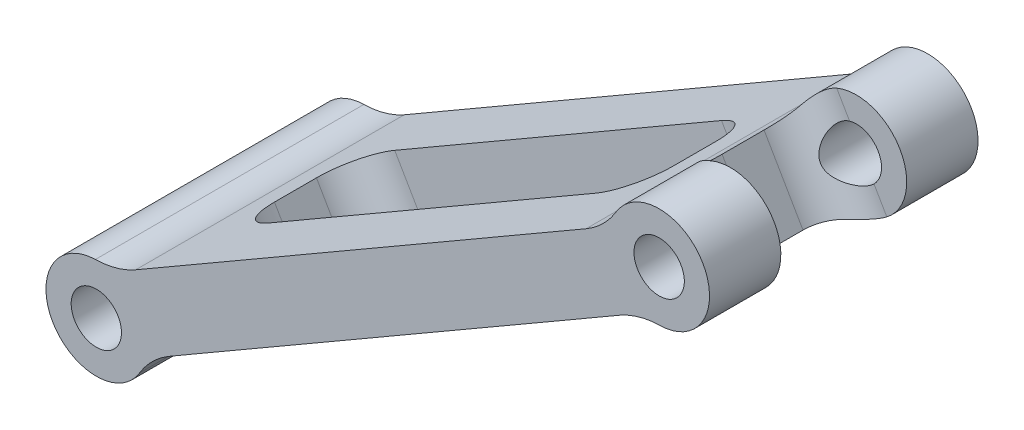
ISO-10303-21;
HEADER;
FILE_DESCRIPTION(('STEP AP214'),'2;1');
FILE_NAME('part.step','',(''),(''),'','','');
FILE_SCHEMA(('AUTOMOTIVE_DESIGN { 1 0 10303 214 1 1 1 1 }'));
ENDSEC;
DATA;
#1=APPLICATION_CONTEXT('core data for automotive mechanical design processes');
#2=APPLICATION_PROTOCOL_DEFINITION('international standard','automotive_design',2000,#1);
#3=PRODUCT_CONTEXT('',#1,'mechanical');
#4=PRODUCT('Part','Part','',(#3));
#5=PRODUCT_RELATED_PRODUCT_CATEGORY('part','',(#4));
#6=PRODUCT_DEFINITION_FORMATION('','',#4);
#7=PRODUCT_DEFINITION_CONTEXT('part definition',#1,'design');
#8=PRODUCT_DEFINITION('design','',#6,#7);
#9=PRODUCT_DEFINITION_SHAPE('','',#8);
#10=(LENGTH_UNIT() NAMED_UNIT(*) SI_UNIT(.MILLI.,.METRE.));
#11=(NAMED_UNIT(*) PLANE_ANGLE_UNIT() SI_UNIT($,.RADIAN.));
#12=(NAMED_UNIT(*) SI_UNIT($,.STERADIAN.) SOLID_ANGLE_UNIT());
#13=UNCERTAINTY_MEASURE_WITH_UNIT(LENGTH_MEASURE(1.E-05),#10,'distance_accuracy_value','');
#14=(GEOMETRIC_REPRESENTATION_CONTEXT(3) GLOBAL_UNCERTAINTY_ASSIGNED_CONTEXT((#13)) GLOBAL_UNIT_ASSIGNED_CONTEXT((#10,
#11,#12)) REPRESENTATION_CONTEXT('',''));
#15=CARTESIAN_POINT('',(0.,0.,0.));
#16=DIRECTION('',(0.,0.,1.));
#17=DIRECTION('',(1.,0.,0.));
#18=AXIS2_PLACEMENT_3D('',#15,#16,#17);
#19=CARTESIAN_POINT('',(-55.437575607,251.385673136,-7.5));
#20=DIRECTION('',(0.,0.,1.));
#21=DIRECTION('',(0.865433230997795,0.501024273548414,0.));
#22=AXIS2_PLACEMENT_3D('',#19,#20,#21);
#23=PLANE('',#22);
#24=DIRECTION('',(0.501024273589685,-0.865433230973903,0.));
#25=VECTOR('',#24,1.);
#26=CARTESIAN_POINT('',(-58.4548701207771,256.59753027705,-7.5));
#27=LINE('',#26,#25);
#28=CARTESIAN_POINT('',(-59.911856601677,259.114223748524,-7.49999999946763));
#29=VERTEX_POINT('',#28);
#30=CARTESIAN_POINT('',(-61.4388819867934,261.751897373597,-7.50000000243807));
#31=VERTEX_POINT('',#30);
#32=EDGE_CURVE('E144',#29,#31,#27,.F.);
#33=ORIENTED_EDGE('',*,*,#32,.F.);
#34=CARTESIAN_POINT('',(-59.10260396,256.225433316,-7.49999999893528));
#35=DIRECTION('',(0.,0.,-1.));
#36=DIRECTION('',(-1.,0.,0.));
#37=AXIS2_PLACEMENT_3D('',#34,#35,#36);
#38=CIRCLE('',#37,3.00000000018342);
#39=CARTESIAN_POINT('',(-57.0003940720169,254.08517314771,-7.49999999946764));
#40=VERTEX_POINT('',#39);
#41=EDGE_CURVE('E165',#40,#29,#38,.F.);
#42=ORIENTED_EDGE('',*,*,#41,.F.);
#43=DIRECTION('',(0.501024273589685,-0.865433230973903,0.));
#44=VECTOR('',#43,1.);
#45=CARTESIAN_POINT('',(-58.4548701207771,256.59753027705,-7.5));
#46=LINE('',#45,#44);
#47=CARTESIAN_POINT('',(-55.473368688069,251.447499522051,-7.50000000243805));
#48=VERTEX_POINT('',#47);
#49=EDGE_CURVE('E139',#48,#40,#46,.F.);
#50=ORIENTED_EDGE('',*,*,#49,.F.);
#51=CARTESIAN_POINT('',(-59.10260396,256.225433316,-7.50000000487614));
#52=DIRECTION('',(0.,0.,-1.));
#53=DIRECTION('',(-1.,0.,0.));
#54=AXIS2_PLACEMENT_3D('',#51,#52,#53);
#55=CIRCLE('',#54,5.99999999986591);
#56=EDGE_CURVE('E21',#48,#31,#55,.F.);
#57=ORIENTED_EDGE('',*,*,#56,.T.);
#58=EDGE_LOOP('',(#33,#42,#50,#57));
#59=FACE_BOUND('',#58,.T.);
#60=ADVANCED_FACE('F17',(#59),#23,.T.);
#61=CARTESIAN_POINT('',(-60.4636101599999,250.087726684,2.5));
#62=DIRECTION('',(0.865433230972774,0.501024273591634,0.));
#63=DIRECTION('',(0.,0.,-1.));
#64=AXIS2_PLACEMENT_3D('',#61,#62,#63);
#65=PLANE('',#64);
#66=DIRECTION('',(0.501024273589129,-0.865433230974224,-2.5687770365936E-11));
#67=VECTOR('',#66,1.);
#68=CARTESIAN_POINT('',(-62.7813431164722,254.091211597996,2.50000000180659));
#69=LINE('',#68,#67);
#70=CARTESIAN_POINT('',(-60.4636101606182,250.087726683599,2.50000000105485));
#71=VERTEX_POINT('',#70);
#72=CARTESIAN_POINT('',(-65.1029728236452,258.101427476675,2.50000000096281));
#73=VERTEX_POINT('',#72);
#74=EDGE_CURVE('E306',#71,#73,#69,.F.);
#75=ORIENTED_EDGE('',*,*,#74,.F.);
#76=DIRECTION('',(0.,0.,-1.));
#77=VECTOR('',#76,1.);
#78=CARTESIAN_POINT('',(-60.4636101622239,250.087726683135,0.));
#79=LINE('',#78,#77);
#80=CARTESIAN_POINT('',(-60.4636101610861,250.087726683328,-2.49999999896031));
#81=VERTEX_POINT('',#80);
#82=EDGE_CURVE('E329',#81,#71,#79,.F.);
#83=ORIENTED_EDGE('',*,*,#82,.F.);
#84=DIRECTION('',(-0.501024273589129,0.865433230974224,6.41878885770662E-13));
#85=VECTOR('',#84,1.);
#86=CARTESIAN_POINT('',(-62.7820362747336,254.092408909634,-2.49999999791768));
#87=LINE('',#86,#85);
#88=CARTESIAN_POINT('',(-65.1029728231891,258.101427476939,-2.49999999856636));
#89=VERTEX_POINT('',#88);
#90=EDGE_CURVE('E156',#89,#81,#87,.F.);
#91=ORIENTED_EDGE('',*,*,#90,.F.);
#92=DIRECTION('',(0.,0.,1.));
#93=VECTOR('',#92,1.);
#94=CARTESIAN_POINT('',(-65.1029728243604,258.101427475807,0.));
#95=LINE('',#94,#93);
#96=EDGE_CURVE('E271',#73,#89,#95,.F.);
#97=ORIENTED_EDGE('',*,*,#96,.F.);
#98=EDGE_LOOP('',(#75,#83,#91,#97));
#99=FACE_BOUND('',#98,.T.);
#100=ADVANCED_FACE('F182',(#99),#65,.T.);
#101=CARTESIAN_POINT('',(-61.4987831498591,261.855366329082,-2.5));
#102=DIRECTION('',(0.501024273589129,-0.865433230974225,0.));
#103=DIRECTION('',(0.865433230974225,0.501024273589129,0.));
#104=AXIS2_PLACEMENT_3D('',#101,#102,#103);
#105=CYLINDRICAL_SURFACE('',#104,5.);
#106=ORIENTED_EDGE('',*,*,#49,.T.);
#107=CARTESIAN_POINT('',(-59.911856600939,259.11422374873,-7.49999999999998));
#108=CARTESIAN_POINT('',(-59.9841684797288,259.093980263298,-7.50001375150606));
#109=CARTESIAN_POINT('',(-60.0557126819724,259.070996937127,-7.49841369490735));
#110=CARTESIAN_POINT('',(-60.196734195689,259.019799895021,-7.49190132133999));
#111=CARTESIAN_POINT('',(-60.2662118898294,258.991587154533,-7.48698962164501));
#112=CARTESIAN_POINT('',(-60.4022792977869,258.93031554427,-7.47380010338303));
#113=CARTESIAN_POINT('',(-60.4688809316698,258.897279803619,-7.46553803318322));
#114=CARTESIAN_POINT('',(-60.5990552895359,258.826611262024,-7.44567775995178));
#115=CARTESIAN_POINT('',(-60.6626280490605,258.788978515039,-7.43407959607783));
#116=CARTESIAN_POINT('',(-60.8481420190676,258.669741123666,-7.3943943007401));
#117=CARTESIAN_POINT('',(-60.9650328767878,258.581727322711,-7.36140137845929));
#118=CARTESIAN_POINT('',(-61.1826974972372,258.392027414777,-7.28384918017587));
#119=CARTESIAN_POINT('',(-61.2834583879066,258.290330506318,-7.23928074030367));
#120=CARTESIAN_POINT('',(-61.4720708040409,258.071369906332,-7.13841921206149));
#121=CARTESIAN_POINT('',(-61.5590826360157,257.953596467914,-7.0816700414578));
#122=CARTESIAN_POINT('',(-61.7137943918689,257.709548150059,-6.96070453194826));
#123=CARTESIAN_POINT('',(-61.7814833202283,257.58326848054,-6.89648397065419));
#124=CARTESIAN_POINT('',(-61.9076117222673,257.3022597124,-6.75215582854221));
#125=CARTESIAN_POINT('',(-61.962484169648,257.146361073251,-6.67121058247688));
#126=CARTESIAN_POINT('',(-62.0460518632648,256.828114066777,-6.50819447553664));
#127=CARTESIAN_POINT('',(-62.0747243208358,256.665760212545,-6.42612269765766));
#128=CARTESIAN_POINT('',(-62.1037772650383,256.350772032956,-6.27418716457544));
#129=CARTESIAN_POINT('',(-62.1064530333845,256.198562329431,-6.20388744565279));
#130=CARTESIAN_POINT('',(-62.0878691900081,255.891042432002,-6.07384392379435));
#131=CARTESIAN_POINT('',(-62.066648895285,255.735737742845,-6.01408296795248));
#132=CARTESIAN_POINT('',(-62.0071692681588,255.465658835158,-5.92681612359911));
#133=CARTESIAN_POINT('',(-61.9748778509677,255.350994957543,-5.89496023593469));
#134=CARTESIAN_POINT('',(-61.8956036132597,255.123846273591,-5.84543514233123));
#135=CARTESIAN_POINT('',(-61.8486709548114,255.011355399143,-5.82771822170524));
#136=CARTESIAN_POINT('',(-61.7798590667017,254.871378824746,-5.81578752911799));
#137=CARTESIAN_POINT('',(-61.7643929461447,254.841225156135,-5.81384181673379));
#138=CARTESIAN_POINT('',(-61.7324202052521,254.78140632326,-5.81124146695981));
#139=CARTESIAN_POINT('',(-61.7159133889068,254.751741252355,-5.81058707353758));
#140=CARTESIAN_POINT('',(-61.6643339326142,254.662648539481,-5.81058900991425));
#141=CARTESIAN_POINT('',(-61.6276869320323,254.604110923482,-5.8132958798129));
#142=CARTESIAN_POINT('',(-61.5506689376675,254.490001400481,-5.82398114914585));
#143=CARTESIAN_POINT('',(-61.5102949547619,254.43443193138,-5.83196381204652));
#144=CARTESIAN_POINT('',(-61.4262070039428,254.326603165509,-5.85282165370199));
#145=CARTESIAN_POINT('',(-61.3824839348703,254.274353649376,-5.86571057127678));
#146=CARTESIAN_POINT('',(-61.2922588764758,254.173606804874,-5.89579239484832));
#147=CARTESIAN_POINT('',(-61.2457551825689,254.125111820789,-5.91298796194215));
#148=CARTESIAN_POINT('',(-61.1040920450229,253.986845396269,-5.96948287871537));
#149=CARTESIAN_POINT('',(-61.005503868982,253.902679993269,-6.01404033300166));
#150=CARTESIAN_POINT('',(-60.8015474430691,253.749569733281,-6.11228160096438));
#151=CARTESIAN_POINT('',(-60.6961776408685,253.680628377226,-6.16596750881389));
#152=CARTESIAN_POINT('',(-60.5067639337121,253.572685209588,-6.26448965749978));
#153=CARTESIAN_POINT('',(-60.4239242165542,253.530500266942,-6.30821162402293));
#154=CARTESIAN_POINT('',(-60.255386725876,253.4542146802,-6.39724693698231));
#155=CARTESIAN_POINT('',(-60.1696880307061,253.420116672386,-6.44256079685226));
#156=CARTESIAN_POINT('',(-59.9955911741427,253.359936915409,-6.53369749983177));
#157=CARTESIAN_POINT('',(-59.9071887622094,253.333868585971,-6.5795210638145));
#158=CARTESIAN_POINT('',(-59.7280843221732,253.289913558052,-6.6706094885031));
#159=CARTESIAN_POINT('',(-59.6373822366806,253.272027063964,-6.71587433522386));
#160=CARTESIAN_POINT('',(-59.4533864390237,253.244550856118,-6.80523238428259));
#161=CARTESIAN_POINT('',(-59.3600794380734,253.235017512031,-6.84931570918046));
#162=CARTESIAN_POINT('',(-59.1719055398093,253.224754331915,-6.93510549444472));
#163=CARTESIAN_POINT('',(-59.0770388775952,253.22402318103,-6.97681230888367));
#164=CARTESIAN_POINT('',(-58.8864977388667,253.231712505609,-7.0569183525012));
#165=CARTESIAN_POINT('',(-58.7908254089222,253.240113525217,-7.09532442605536));
#166=CARTESIAN_POINT('',(-58.5992872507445,253.266375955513,-7.16808289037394));
#167=CARTESIAN_POINT('',(-58.5034215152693,253.284233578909,-7.20243689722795));
#168=CARTESIAN_POINT('',(-58.2664978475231,253.340644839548,-7.28166333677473));
#169=CARTESIAN_POINT('',(-58.1257989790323,253.385015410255,-7.32368679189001));
#170=CARTESIAN_POINT('',(-57.8499178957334,253.49545000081,-7.39495235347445));
#171=CARTESIAN_POINT('',(-57.7147290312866,253.561486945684,-7.42421030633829));
#172=CARTESIAN_POINT('',(-57.4792920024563,253.699620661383,-7.46447389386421));
#173=CARTESIAN_POINT('',(-57.3773314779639,253.76809623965,-7.47791059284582));
#174=CARTESIAN_POINT('',(-57.2308484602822,253.880154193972,-7.49123860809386));
#175=CARTESIAN_POINT('',(-57.1830372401,253.919122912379,-7.49454327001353));
#176=CARTESIAN_POINT('',(-57.0898386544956,253.99999297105,-7.49892603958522));
#177=CARTESIAN_POINT('',(-57.044451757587,254.041894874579,-7.50000371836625));
#178=CARTESIAN_POINT('',(-57.0003940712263,254.085173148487,-7.49999999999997));
#179=B_SPLINE_CURVE_WITH_KNOTS('',3,(#107,#108,#109,#110,#111,#112,#113,#114,#115,#116,#117,
#118,#119,#120,#121,#122,#123,#124,#125,#126,#127,#128,#129,#130,#131,#132,#133,#134,#135,#136,
#137,#138,#139,#140,#141,#142,#143,#144,#145,#146,#147,#148,#149,#150,#151,#152,#153,#154,#155,
#156,#157,#158,#159,#160,#161,#162,#163,#164,#165,#166,#167,#168,#169,#170,#171,#172,#173,#174,
#175,#176,#177,#178),.UNSPECIFIED.,.F.,.F.,(4,2,2,2,2,2,2,2,2,2,2,2,2,2,2,2,2,2,2,2,2,2,2,2,2,2,
2,2,2,2,2,2,2,2,2,4),(0.,0.225203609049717,0.450365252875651,0.674480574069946,
0.898593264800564,1.34631593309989,1.79439413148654,2.26373923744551,2.73335088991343,
3.28335419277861,3.83383543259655,4.3352191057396,4.83577903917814,5.2043570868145,
5.571685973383,5.67349034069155,5.77531393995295,5.98225503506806,6.18936356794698,
6.39705637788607,6.6048778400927,7.01434620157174,7.42390862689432,7.73173635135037,
8.03966428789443,8.34810409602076,8.65655160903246,8.96706493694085,9.27753188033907,
9.5873386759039,9.89702149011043,10.3551126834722,10.8126335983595,11.1819714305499,
11.3671383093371,11.5523408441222),.UNSPECIFIED.);
#180=EDGE_CURVE('E155',#29,#40,#179,.T.);
#181=ORIENTED_EDGE('',*,*,#180,.F.);
#182=ORIENTED_EDGE('',*,*,#32,.T.);
#183=CARTESIAN_POINT('',(-61.4388819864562,261.75189737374,-7.49999999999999));
#184=CARTESIAN_POINT('',(-61.5455358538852,261.70683950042,-7.50002640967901));
#185=CARTESIAN_POINT('',(-61.650861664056,261.658647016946,-7.4960419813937));
#186=CARTESIAN_POINT('',(-61.8580333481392,261.556554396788,-7.48006966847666));
#187=CARTESIAN_POINT('',(-61.9598805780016,261.502656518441,-7.46808494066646));
#188=CARTESIAN_POINT('',(-62.1584323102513,261.390201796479,-7.43627831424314));
#189=CARTESIAN_POINT('',(-62.255175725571,261.331692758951,-7.41653007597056));
#190=CARTESIAN_POINT('',(-62.443895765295,261.210245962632,-7.36938262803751));
#191=CARTESIAN_POINT('',(-62.53587225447,261.147308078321,-7.3419832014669));
#192=CARTESIAN_POINT('',(-62.7144524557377,261.017791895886,-7.27985453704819));
#193=CARTESIAN_POINT('',(-62.8010625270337,260.951218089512,-7.24513419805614));
#194=CARTESIAN_POINT('',(-62.9687018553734,260.81509193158,-7.16871061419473));
#195=CARTESIAN_POINT('',(-63.0497289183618,260.745538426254,-7.12700464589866));
#196=CARTESIAN_POINT('',(-63.2846006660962,260.533041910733,-6.99170755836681));
#197=CARTESIAN_POINT('',(-63.4297096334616,260.386650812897,-6.88812363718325));
#198=CARTESIAN_POINT('',(-63.702310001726,260.083699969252,-6.65256947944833));
#199=CARTESIAN_POINT('',(-63.8286646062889,259.926984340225,-6.519500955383));
#200=CARTESIAN_POINT('',(-63.9992708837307,259.694131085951,-6.30406303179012));
#201=CARTESIAN_POINT('',(-64.052868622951,259.617083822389,-6.22982781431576));
#202=CARTESIAN_POINT('',(-64.154180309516,259.464256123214,-6.07632135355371));
#203=CARTESIAN_POINT('',(-64.2018978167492,259.388474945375,-5.99705320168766));
#204=CARTESIAN_POINT('',(-64.2468377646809,259.313613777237,-5.91537891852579));
#205=B_SPLINE_CURVE_WITH_KNOTS('',3,(#183,#184,#185,#186,#187,#188,#189,#190,#191,#192,#193,
#194,#195,#196,#197,#198,#199,#200,#201,#202,#203,#204),.UNSPECIFIED.,.F.,.F.,(4,2,2,2,2,2,2,2,
2,2,4),(0.,0.347219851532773,0.694302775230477,1.03816910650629,1.38204518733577,
1.7255056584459,2.06910034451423,2.75830534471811,3.47964289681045,3.83842270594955,
4.1969842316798),.UNSPECIFIED.);
#206=CARTESIAN_POINT('',(-64.2468377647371,259.313613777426,-5.91537891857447));
#207=VERTEX_POINT('',#206);
#208=EDGE_CURVE('E147',#31,#207,#205,.T.);
#209=ORIENTED_EDGE('',*,*,#208,.T.);
#210=CARTESIAN_POINT('',(-65.1029728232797,258.101427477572,-2.49999999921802));
#211=CARTESIAN_POINT('',(-65.1029953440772,258.101430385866,-2.63101334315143));
#212=CARTESIAN_POINT('',(-65.0994789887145,258.105668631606,-2.76202587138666));
#213=CARTESIAN_POINT('',(-65.0855299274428,258.122638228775,-3.0231328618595));
#214=CARTESIAN_POINT('',(-65.0750970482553,258.135369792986,-3.15322730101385));
#215=CARTESIAN_POINT('',(-65.0474735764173,258.169351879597,-3.41160102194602));
#216=CARTESIAN_POINT('',(-65.0302816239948,258.190604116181,-3.53987993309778));
#217=CARTESIAN_POINT('',(-64.9894622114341,258.24166090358,-3.79367569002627));
#218=CARTESIAN_POINT('',(-64.9658350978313,258.271464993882,-3.91919268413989));
#219=CARTESIAN_POINT('',(-64.9125498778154,258.339695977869,-4.16672151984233));
#220=CARTESIAN_POINT('',(-64.8828844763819,258.378133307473,-4.28872891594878));
#221=CARTESIAN_POINT('',(-64.8181059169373,258.463616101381,-4.52819696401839));
#222=CARTESIAN_POINT('',(-64.782992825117,258.510661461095,-4.64565767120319));
#223=CARTESIAN_POINT('',(-64.7080613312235,258.613241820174,-4.87500889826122));
#224=CARTESIAN_POINT('',(-64.6682503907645,258.668763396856,-4.98690786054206));
#225=CARTESIAN_POINT('',(-64.5846833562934,258.788224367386,-5.20451079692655));
#226=CARTESIAN_POINT('',(-64.5409288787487,258.852160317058,-5.31021728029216));
#227=CARTESIAN_POINT('',(-64.4560713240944,258.979667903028,-5.50183855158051));
#228=CARTESIAN_POINT('',(-64.4153321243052,259.042264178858,-5.58856618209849));
#229=CARTESIAN_POINT('',(-64.3321869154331,259.173469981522,-5.7563129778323));
#230=CARTESIAN_POINT('',(-64.2897828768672,259.242072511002,-5.83733859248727));
#231=CARTESIAN_POINT('',(-64.2468377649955,259.313613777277,-5.91537891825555));
#232=B_SPLINE_CURVE_WITH_KNOTS('',3,(#210,#211,#212,#213,#214,#215,#216,#217,#218,#219,#220,
#221,#222,#223,#224,#225,#226,#227,#228,#229,#230,#231),.UNSPECIFIED.,.F.,.F.,(4,2,2,2,2,2,2,2,
2,2,4),(0.,0.392923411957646,0.785856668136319,1.17886901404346,1.57186020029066,
1.96532901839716,2.35879305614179,2.75164035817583,3.14432735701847,3.48738101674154,
3.83004020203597),.UNSPECIFIED.);
#233=EDGE_CURVE('E190',#89,#207,#232,.T.);
#234=ORIENTED_EDGE('',*,*,#233,.F.);
#235=ORIENTED_EDGE('',*,*,#90,.T.);
#236=CARTESIAN_POINT('',(-58.9860828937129,250.226564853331,-5.91537891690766));
#237=CARTESIAN_POINT('',(-59.0815164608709,250.224714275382,-5.82612117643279));
#238=CARTESIAN_POINT('',(-59.1732572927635,250.221562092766,-5.73294037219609));
#239=CARTESIAN_POINT('',(-59.348636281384,250.213325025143,-5.53932625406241));
#240=CARTESIAN_POINT('',(-59.4322746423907,250.208240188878,-5.43889312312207));
#241=CARTESIAN_POINT('',(-59.5907109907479,250.1968099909,-5.23139664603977));
#242=CARTESIAN_POINT('',(-59.6655118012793,250.190465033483,-5.12433543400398));
#243=CARTESIAN_POINT('',(-59.8057385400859,250.177171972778,-4.90428554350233));
#244=CARTESIAN_POINT('',(-59.8711650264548,250.170223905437,-4.79129721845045));
#245=CARTESIAN_POINT('',(-59.9922492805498,250.15633250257,-4.56007674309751));
#246=CARTESIAN_POINT('',(-60.0478984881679,250.149389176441,-4.44184011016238));
#247=CARTESIAN_POINT('',(-60.1490148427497,250.136063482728,-4.2010595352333));
#248=CARTESIAN_POINT('',(-60.19448190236,250.129681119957,-4.07851555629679));
#249=CARTESIAN_POINT('',(-60.2749284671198,250.117951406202,-3.83016241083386));
#250=CARTESIAN_POINT('',(-60.3099215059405,250.112602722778,-3.70435768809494));
#251=CARTESIAN_POINT('',(-60.3693136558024,250.10329791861,-3.45027100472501));
#252=CARTESIAN_POINT('',(-60.3937169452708,250.099341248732,-3.32199004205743));
#253=CARTESIAN_POINT('',(-60.4297134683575,250.093429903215,-3.07819086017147));
#254=CARTESIAN_POINT('',(-60.4424301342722,250.09130142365,-2.96284119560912));
#255=CARTESIAN_POINT('',(-60.4593748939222,250.088444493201,-2.7316623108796));
#256=CARTESIAN_POINT('',(-60.4636146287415,250.087714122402,-2.61583396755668));
#257=CARTESIAN_POINT('',(-60.4636101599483,250.087726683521,-2.49999999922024));
#258=B_SPLINE_CURVE_WITH_KNOTS('',3,(#236,#237,#238,#239,#240,#241,#242,#243,#244,#245,#246,
#247,#248,#249,#250,#251,#252,#253,#254,#255,#256,#257),.UNSPECIFIED.,.F.,.F.,(4,2,2,2,2,2,2,2,
2,2,4),(0.,0.391934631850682,0.78385937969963,1.17565858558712,1.56743445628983,
1.95955163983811,2.35167218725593,2.74328385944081,3.13474087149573,3.48263012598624,
3.830041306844),.UNSPECIFIED.);
#259=CARTESIAN_POINT('',(-58.9860828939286,250.226564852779,-5.91537891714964));
#260=VERTEX_POINT('',#259);
#261=EDGE_CURVE('E198',#260,#81,#258,.T.);
#262=ORIENTED_EDGE('',*,*,#261,.F.);
#263=CARTESIAN_POINT('',(-58.9860828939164,250.226564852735,-5.9153789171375));
#264=CARTESIAN_POINT('',(-58.8871281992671,250.228479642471,-6.00796097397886));
#265=CARTESIAN_POINT('',(-58.7853213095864,250.232913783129,-6.09749049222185));
#266=CARTESIAN_POINT('',(-58.5765915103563,250.247620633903,-6.27004717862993));
#267=CARTESIAN_POINT('',(-58.4696640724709,250.257898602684,-6.35306841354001));
#268=CARTESIAN_POINT('',(-58.2504429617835,250.285219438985,-6.51278536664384));
#269=CARTESIAN_POINT('',(-58.1381084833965,250.302324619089,-6.58941473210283));
#270=CARTESIAN_POINT('',(-57.9098415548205,250.344041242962,-6.73483426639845));
#271=CARTESIAN_POINT('',(-57.7939100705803,250.368650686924,-6.80362651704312));
#272=CARTESIAN_POINT('',(-57.5585098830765,250.426247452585,-6.93316501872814));
#273=CARTESIAN_POINT('',(-57.439021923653,250.459292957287,-6.99385074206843));
#274=CARTESIAN_POINT('',(-57.1984333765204,250.534211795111,-7.10583838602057));
#275=CARTESIAN_POINT('',(-57.0773331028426,250.576083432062,-7.15714210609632));
#276=CARTESIAN_POINT('',(-56.8354548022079,250.668752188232,-7.24939097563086));
#277=CARTESIAN_POINT('',(-56.7146787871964,250.719497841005,-7.29039270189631));
#278=CARTESIAN_POINT('',(-56.4742594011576,250.830128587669,-7.36176682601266));
#279=CARTESIAN_POINT('',(-56.3546154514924,250.890008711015,-7.39214497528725));
#280=CARTESIAN_POINT('',(-56.1048361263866,251.025845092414,-7.44458191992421));
#281=CARTESIAN_POINT('',(-55.974990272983,251.102844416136,-7.46536191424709));
#282=CARTESIAN_POINT('',(-55.7839294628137,251.226213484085,-7.48615142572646));
#283=CARTESIAN_POINT('',(-55.7207327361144,251.26874507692,-7.49135111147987));
#284=CARTESIAN_POINT('',(-55.5958563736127,251.356291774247,-7.49827680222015));
#285=CARTESIAN_POINT('',(-55.5341772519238,251.401307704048,-7.50000164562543));
#286=CARTESIAN_POINT('',(-55.4733686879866,251.447499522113,-7.49999999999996));
#287=B_SPLINE_CURVE_WITH_KNOTS('',3,(#263,#264,#265,#266,#267,#268,#269,#270,#271,#272,#273,
#274,#275,#276,#277,#278,#279,#280,#281,#282,#283,#284,#285,#286),.UNSPECIFIED.,.F.,.F.,(4,2,2,
2,2,2,2,2,2,2,2,4),(0.,0.406538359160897,0.81344312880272,1.22414993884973,1.63474739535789,
2.04825705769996,2.46168732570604,2.87279487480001,3.28367951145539,3.73965449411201,
3.96859807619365,4.19761817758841),.UNSPECIFIED.);
#288=EDGE_CURVE('E164',#260,#48,#287,.T.);
#289=ORIENTED_EDGE('',*,*,#288,.T.);
#290=EDGE_LOOP('',(#106,#181,#182,#209,#234,#235,#262,#289));
#291=FACE_BOUND('',#290,.T.);
#292=ADVANCED_FACE('F151',(#291),#105,.F.);
#293=CARTESIAN_POINT('',(-71.164393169,244.620552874,7.5));
#294=DIRECTION('',(0.,0.,-1.));
#295=DIRECTION('',(-0.865433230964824,-0.501024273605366,0.));
#296=AXIS2_PLACEMENT_3D('',#293,#294,#295);
#297=PLANE('',#296);
#298=DIRECTION('',(0.865433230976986,0.501024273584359,0.));
#299=VECTOR('',#298,1.);
#300=CARTESIAN_POINT('',(-94.6448350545,240.270972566,7.5));
#301=LINE('',#300,#299);
#302=CARTESIAN_POINT('',(-114.117082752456,228.997926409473,7.5));
#303=VERTEX_POINT('',#302);
#304=CARTESIAN_POINT('',(-75.1725873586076,251.544018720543,7.5));
#305=VERTEX_POINT('',#304);
#306=EDGE_CURVE('E396',#303,#305,#301,.T.);
#307=ORIENTED_EDGE('',*,*,#306,.T.);
#308=DIRECTION('',(0.501024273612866,-0.865433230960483,0.));
#309=VECTOR('',#308,1.);
#310=CARTESIAN_POINT('',(-73.1684902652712,248.082285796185,7.5));
#311=LINE('',#310,#309);
#312=CARTESIAN_POINT('',(-71.1643931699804,244.620552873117,7.50000000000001));
#313=VERTEX_POINT('',#312);
#314=EDGE_CURVE('E321',#313,#305,#311,.F.);
#315=ORIENTED_EDGE('',*,*,#314,.F.);
#316=DIRECTION('',(-0.865433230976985,-0.50102427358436,0.));
#317=VECTOR('',#316,1.);
#318=CARTESIAN_POINT('',(-90.6366408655,233.347506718,7.50000000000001));
#319=LINE('',#318,#317);
#320=CARTESIAN_POINT('',(-110.108888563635,222.074460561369,7.5));
#321=VERTEX_POINT('',#320);
#322=EDGE_CURVE('E467',#313,#321,#319,.T.);
#323=ORIENTED_EDGE('',*,*,#322,.T.);
#324=DIRECTION('',(-0.501024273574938,0.86543323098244,0.));
#325=VECTOR('',#324,1.);
#326=CARTESIAN_POINT('',(-112.11298565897,225.53619348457,7.5));
#327=LINE('',#326,#325);
#328=EDGE_CURVE('E302',#303,#321,#327,.F.);
#329=ORIENTED_EDGE('',*,*,#328,.F.);
#330=EDGE_LOOP('',(#307,#315,#323,#329));
#331=FACE_BOUND('',#330,.T.);
#332=ADVANCED_FACE('F181',(#331),#297,.T.);
#333=CARTESIAN_POINT('',(-75.172587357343,251.544018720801,2.5));
#334=DIRECTION('',(0.501024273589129,-0.865433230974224,0.));
#335=DIRECTION('',(0.865433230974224,0.501024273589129,0.));
#336=AXIS2_PLACEMENT_3D('',#333,#334,#335);
#337=CYLINDRICAL_SURFACE('',#336,5.);
#338=CARTESIAN_POINT('',(-75.172587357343,251.544018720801,2.5));
#339=DIRECTION('',(0.501024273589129,-0.865433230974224,0.));
#340=DIRECTION('',(0.865433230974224,0.501024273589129,0.));
#341=AXIS2_PLACEMENT_3D('',#338,#339,#340);
#342=CIRCLE('',#341,5.);
#343=CARTESIAN_POINT('',(-70.8454212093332,254.049140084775,2.5));
#344=VERTEX_POINT('',#343);
#345=EDGE_CURVE('E403',#305,#344,#342,.F.);
#346=ORIENTED_EDGE('',*,*,#345,.T.);
#347=DIRECTION('',(-0.501024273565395,0.865433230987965,0.));
#348=VECTOR('',#347,1.);
#349=CARTESIAN_POINT('',(-68.841324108,250.5874071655,2.5));
#350=LINE('',#349,#348);
#351=CARTESIAN_POINT('',(-66.8372270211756,247.125674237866,2.49999999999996));
#352=VERTEX_POINT('',#351);
#353=EDGE_CURVE('E318',#352,#344,#350,.T.);
#354=ORIENTED_EDGE('',*,*,#353,.F.);
#355=CARTESIAN_POINT('',(-71.1643931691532,244.620552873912,2.49999999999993));
#356=DIRECTION('',(0.501024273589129,-0.865433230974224,0.));
#357=DIRECTION('',(0.865433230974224,0.501024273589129,0.));
#358=AXIS2_PLACEMENT_3D('',#355,#356,#357);
#359=CIRCLE('',#358,5.);
#360=EDGE_CURVE('E469',#352,#313,#359,.T.);
#361=ORIENTED_EDGE('',*,*,#360,.T.);
#362=ORIENTED_EDGE('',*,*,#314,.T.);
#363=EDGE_LOOP('',(#346,#354,#361,#362));
#364=FACE_BOUND('',#363,.T.);
#365=ADVANCED_FACE('F183',(#364),#337,.F.);
#366=CARTESIAN_POINT('',(-66.837227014,247.125674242,-2.5));
#367=DIRECTION('',(-0.865433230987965,-0.501024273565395,0.));
#368=DIRECTION('',(0.,0.,1.));
#369=AXIS2_PLACEMENT_3D('',#366,#367,#368);
#370=PLANE('',#369);
#371=DIRECTION('',(0.,0.,-1.));
#372=VECTOR('',#371,1.);
#373=CARTESIAN_POINT('',(-70.845421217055,254.049140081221,0.));
#374=LINE('',#373,#372);
#375=CARTESIAN_POINT('',(-70.8454212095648,254.049140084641,-2.49999999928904));
#376=VERTEX_POINT('',#375);
#377=EDGE_CURVE('E484',#344,#376,#374,.T.);
#378=ORIENTED_EDGE('',*,*,#377,.T.);
#379=DIRECTION('',(0.501024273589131,-0.865433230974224,-2.74268455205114E-11));
#380=VECTOR('',#379,1.);
#381=CARTESIAN_POINT('',(-68.841324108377,250.587407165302,-2.49999999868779));
#382=LINE('',#381,#380);
#383=CARTESIAN_POINT('',(-66.8372270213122,247.125674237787,-2.49999999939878));
#384=VERTEX_POINT('',#383);
#385=EDGE_CURVE('E315',#384,#376,#382,.F.);
#386=ORIENTED_EDGE('',*,*,#385,.F.);
#387=DIRECTION('',(0.,0.,1.));
#388=VECTOR('',#387,1.);
#389=CARTESIAN_POINT('',(-66.837227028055,247.12567423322,0.));
#390=LINE('',#389,#388);
#391=EDGE_CURVE('E470',#384,#352,#390,.T.);
#392=ORIENTED_EDGE('',*,*,#391,.T.);
#393=ORIENTED_EDGE('',*,*,#353,.T.);
#394=EDGE_LOOP('',(#378,#386,#392,#393));
#395=FACE_BOUND('',#394,.T.);
#396=ADVANCED_FACE('F518',(#395),#370,.T.);
#397=CARTESIAN_POINT('',(-75.172587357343,251.544018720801,-2.5));
#398=DIRECTION('',(0.501024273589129,-0.865433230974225,0.));
#399=DIRECTION('',(0.865433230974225,0.501024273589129,0.));
#400=AXIS2_PLACEMENT_3D('',#397,#398,#399);
#401=CYLINDRICAL_SURFACE('',#400,5.);
#402=CARTESIAN_POINT('',(-75.172587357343,251.544018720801,-2.5));
#403=DIRECTION('',(0.501024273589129,-0.865433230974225,0.));
#404=DIRECTION('',(0.865433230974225,0.501024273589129,0.));
#405=AXIS2_PLACEMENT_3D('',#402,#403,#404);
#406=CIRCLE('',#405,5.);
#407=CARTESIAN_POINT('',(-75.172587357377,251.544018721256,-7.50000000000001));
#408=VERTEX_POINT('',#407);
#409=EDGE_CURVE('E483',#376,#408,#406,.F.);
#410=ORIENTED_EDGE('',*,*,#409,.T.);
#411=DIRECTION('',(-0.501024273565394,0.865433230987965,0.));
#412=VECTOR('',#411,1.);
#413=CARTESIAN_POINT('',(-73.168490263,248.0822857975,-7.5));
#414=LINE('',#413,#412);
#415=CARTESIAN_POINT('',(-71.1643931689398,244.620552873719,-7.5));
#416=VERTEX_POINT('',#415);
#417=EDGE_CURVE('E312',#416,#408,#414,.T.);
#418=ORIENTED_EDGE('',*,*,#417,.F.);
#419=CARTESIAN_POINT('',(-71.1643931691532,244.620552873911,-2.50000000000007));
#420=DIRECTION('',(0.501024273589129,-0.865433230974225,0.));
#421=DIRECTION('',(0.865433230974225,0.501024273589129,0.));
#422=AXIS2_PLACEMENT_3D('',#419,#420,#421);
#423=CIRCLE('',#422,5.);
#424=EDGE_CURVE('E473',#416,#384,#423,.T.);
#425=ORIENTED_EDGE('',*,*,#424,.T.);
#426=ORIENTED_EDGE('',*,*,#385,.T.);
#427=EDGE_LOOP('',(#410,#418,#425,#426));
#428=FACE_BOUND('',#427,.T.);
#429=ADVANCED_FACE('F517',(#428),#401,.F.);
#430=CARTESIAN_POINT('',(-110.108888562,222.074460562,-7.5));
#431=DIRECTION('',(0.,0.,1.));
#432=DIRECTION('',(0.865433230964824,0.501024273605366,0.));
#433=AXIS2_PLACEMENT_3D('',#430,#431,#432);
#434=PLANE('',#433);
#435=DIRECTION('',(-0.865433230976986,-0.501024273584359,0.));
#436=VECTOR('',#435,1.);
#437=CARTESIAN_POINT('',(-94.6448350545,240.270972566,-7.5));
#438=LINE('',#437,#436);
#439=CARTESIAN_POINT('',(-114.117082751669,228.997926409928,-7.5));
#440=VERTEX_POINT('',#439);
#441=EDGE_CURVE('E481',#408,#440,#438,.T.);
#442=ORIENTED_EDGE('',*,*,#441,.T.);
#443=DIRECTION('',(0.501024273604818,-0.865433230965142,0.));
#444=VECTOR('',#443,1.);
#445=CARTESIAN_POINT('',(-112.112985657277,225.53619348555,-7.5));
#446=LINE('',#445,#444);
#447=CARTESIAN_POINT('',(-110.108888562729,222.074460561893,-7.5));
#448=VERTEX_POINT('',#447);
#449=EDGE_CURVE('E309',#448,#440,#446,.F.);
#450=ORIENTED_EDGE('',*,*,#449,.F.);
#451=DIRECTION('',(0.865433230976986,0.501024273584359,0.));
#452=VECTOR('',#451,1.);
#453=CARTESIAN_POINT('',(-90.6366408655,233.347506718,-7.5));
#454=LINE('',#453,#452);
#455=EDGE_CURVE('E474',#448,#416,#454,.T.);
#456=ORIENTED_EDGE('',*,*,#455,.T.);
#457=ORIENTED_EDGE('',*,*,#417,.T.);
#458=EDGE_LOOP('',(#442,#450,#456,#457));
#459=FACE_BOUND('',#458,.T.);
#460=ADVANCED_FACE('F514',(#459),#434,.T.);
#461=CARTESIAN_POINT('',(-114.117082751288,228.997926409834,-2.5));
#462=DIRECTION('',(0.501024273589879,-0.86543323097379,0.));
#463=DIRECTION('',(0.86543323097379,0.501024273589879,0.));
#464=AXIS2_PLACEMENT_3D('',#461,#462,#463);
#465=CYLINDRICAL_SURFACE('',#464,5.);
#466=CARTESIAN_POINT('',(-114.117082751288,228.997926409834,-2.5));
#467=DIRECTION('',(0.501024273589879,-0.86543323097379,0.));
#468=DIRECTION('',(0.86543323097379,0.501024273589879,0.));
#469=AXIS2_PLACEMENT_3D('',#466,#467,#468);
#470=CIRCLE('',#469,5.);
#471=CARTESIAN_POINT('',(-118.444248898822,226.49280504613,-2.5));
#472=VERTEX_POINT('',#471);
#473=EDGE_CURVE('E480',#440,#472,#470,.F.);
#474=ORIENTED_EDGE('',*,*,#473,.T.);
#475=DIRECTION('',(-0.501024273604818,0.865433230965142,0.));
#476=VECTOR('',#475,1.);
#477=CARTESIAN_POINT('',(-116.4401518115,223.031072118,-2.5));
#478=LINE('',#477,#476);
#479=CARTESIAN_POINT('',(-114.436054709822,219.56933919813,-2.5));
#480=VERTEX_POINT('',#479);
#481=EDGE_CURVE('E303',#480,#472,#478,.T.);
#482=ORIENTED_EDGE('',*,*,#481,.F.);
#483=CARTESIAN_POINT('',(-110.108888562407,222.074460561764,-2.5));
#484=DIRECTION('',(0.501024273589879,-0.86543323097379,0.));
#485=DIRECTION('',(0.86543323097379,0.501024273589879,0.));
#486=AXIS2_PLACEMENT_3D('',#483,#484,#485);
#487=CIRCLE('',#486,5.);
#488=EDGE_CURVE('E211',#480,#448,#487,.T.);
#489=ORIENTED_EDGE('',*,*,#488,.T.);
#490=ORIENTED_EDGE('',*,*,#449,.T.);
#491=EDGE_LOOP('',(#474,#482,#489,#490));
#492=FACE_BOUND('',#491,.T.);
#493=ADVANCED_FACE('F493',(#492),#465,.F.);
#494=CARTESIAN_POINT('',(-114.436054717,219.569339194,2.5));
#495=DIRECTION('',(0.865433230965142,0.501024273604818,0.));
#496=DIRECTION('',(0.,0.,-1.));
#497=AXIS2_PLACEMENT_3D('',#494,#495,#496);
#498=PLANE('',#497);
#499=DIRECTION('',(0.,0.,1.));
#500=VECTOR('',#499,1.);
#501=CARTESIAN_POINT('',(-118.444248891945,226.492805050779,0.));
#502=LINE('',#501,#500);
#503=CARTESIAN_POINT('',(-118.444248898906,226.492805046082,2.50000000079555));
#504=VERTEX_POINT('',#503);
#505=EDGE_CURVE('E391',#472,#504,#502,.T.);
#506=ORIENTED_EDGE('',*,*,#505,.T.);
#507=DIRECTION('',(0.50102427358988,-0.86543323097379,-1.72622333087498E-11));
#508=VECTOR('',#507,1.);
#509=CARTESIAN_POINT('',(-116.440151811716,223.03107211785,2.50000000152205));
#510=LINE('',#509,#508);
#511=CARTESIAN_POINT('',(-114.436054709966,219.569339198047,2.5000000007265));
#512=VERTEX_POINT('',#511);
#513=EDGE_CURVE('E299',#512,#504,#510,.F.);
#514=ORIENTED_EDGE('',*,*,#513,.F.);
#515=DIRECTION('',(0.,0.,-1.));
#516=VECTOR('',#515,1.);
#517=CARTESIAN_POINT('',(-114.436054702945,219.569339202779,0.));
#518=LINE('',#517,#516);
#519=EDGE_CURVE('E210',#512,#480,#518,.T.);
#520=ORIENTED_EDGE('',*,*,#519,.T.);
#521=ORIENTED_EDGE('',*,*,#481,.T.);
#522=EDGE_LOOP('',(#506,#514,#520,#521));
#523=FACE_BOUND('',#522,.T.);
#524=ADVANCED_FACE('F499',(#523),#498,.T.);
#525=CARTESIAN_POINT('',(-114.117082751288,228.997926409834,2.5));
#526=DIRECTION('',(0.501024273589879,-0.86543323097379,0.));
#527=DIRECTION('',(0.86543323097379,0.501024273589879,0.));
#528=AXIS2_PLACEMENT_3D('',#525,#526,#527);
#529=CYLINDRICAL_SURFACE('',#528,5.);
#530=CARTESIAN_POINT('',(-114.117082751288,228.997926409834,2.5));
#531=DIRECTION('',(0.501024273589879,-0.86543323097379,0.));
#532=DIRECTION('',(0.86543323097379,0.501024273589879,0.));
#533=AXIS2_PLACEMENT_3D('',#530,#531,#532);
#534=CIRCLE('',#533,5.);
#535=EDGE_CURVE('E382',#504,#303,#534,.F.);
#536=ORIENTED_EDGE('',*,*,#535,.T.);
#537=ORIENTED_EDGE('',*,*,#328,.T.);
#538=CARTESIAN_POINT('',(-110.108888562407,222.074460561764,2.5));
#539=DIRECTION('',(0.501024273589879,-0.86543323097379,0.));
#540=DIRECTION('',(0.86543323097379,0.501024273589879,0.));
#541=AXIS2_PLACEMENT_3D('',#538,#539,#540);
#542=CIRCLE('',#541,5.);
#543=EDGE_CURVE('E231',#321,#512,#542,.T.);
#544=ORIENTED_EDGE('',*,*,#543,.T.);
#545=ORIENTED_EDGE('',*,*,#513,.T.);
#546=EDGE_LOOP('',(#536,#537,#544,#545));
#547=FACE_BOUND('',#546,.T.);
#548=ADVANCED_FACE('F237',(#547),#529,.F.);
#549=CARTESIAN_POINT('',(-61.5011681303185,261.859485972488,2.5));
#550=DIRECTION('',(0.501024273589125,-0.865433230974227,0.));
#551=DIRECTION('',(0.865433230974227,0.501024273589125,0.));
#552=AXIS2_PLACEMENT_3D('',#549,#550,#551);
#553=CYLINDRICAL_SURFACE('',#552,5.);
#554=DIRECTION('',(-0.501024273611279,0.865433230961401,0.));
#555=VECTOR('',#554,1.);
#556=CARTESIAN_POINT('',(-58.456125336,256.5996984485,7.5));
#557=LINE('',#556,#555);
#558=CARTESIAN_POINT('',(-59.9118566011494,259.114223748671,7.49999999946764));
#559=VERTEX_POINT('',#558);
#560=CARTESIAN_POINT('',(-61.4388819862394,261.751897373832,7.50000000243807));
#561=VERTEX_POINT('',#560);
#562=EDGE_CURVE('E328',#559,#561,#557,.T.);
#563=ORIENTED_EDGE('',*,*,#562,.F.);
#564=CARTESIAN_POINT('',(-57.000394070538,254.085173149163,7.50000000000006));
#565=CARTESIAN_POINT('',(-57.0539569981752,254.032544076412,7.50001375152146));
#566=CARTESIAN_POINT('',(-57.1095136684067,253.981945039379,7.49841369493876));
#567=CARTESIAN_POINT('',(-57.2241336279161,253.885143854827,7.49190132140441));
#568=CARTESIAN_POINT('',(-57.2831962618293,253.838940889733,7.48698962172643));
#569=CARTESIAN_POINT('',(-57.4040860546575,253.751452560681,7.47380010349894));
#570=CARTESIAN_POINT('',(-57.4658990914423,253.710145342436,7.4655380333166));
#571=CARTESIAN_POINT('',(-57.5920035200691,253.632446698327,7.44567776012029));
#572=CARTESIAN_POINT('',(-57.6562948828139,253.596055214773,7.43407959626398));
#573=CARTESIAN_POINT('',(-57.8520748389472,253.494550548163,7.3943943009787));
#574=CARTESIAN_POINT('',(-57.9866066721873,253.437008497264,7.36140137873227));
#575=CARTESIAN_POINT('',(-58.2595015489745,253.342709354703,7.28384918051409));
#576=CARTESIAN_POINT('',(-58.3978675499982,253.305968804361,7.23928074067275));
#577=CARTESIAN_POINT('',(-58.6816709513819,253.251434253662,7.13841921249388));
#578=CARTESIAN_POINT('',(-58.8271322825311,253.234622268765,7.08167004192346));
#579=CARTESIAN_POINT('',(-59.1158110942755,253.221978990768,6.96070453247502));
#580=CARTESIAN_POINT('',(-59.2590272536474,253.226159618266,6.89648397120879));
#581=CARTESIAN_POINT('',(-59.565525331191,253.256708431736,6.7521558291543));
#582=CARTESIAN_POINT('',(-59.7280452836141,253.286752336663,6.67121058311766));
#583=CARTESIAN_POINT('',(-60.0456435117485,253.372752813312,6.50819447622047));
#584=CARTESIAN_POINT('',(-60.2007151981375,253.428731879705,6.42612269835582));
#585=CARTESIAN_POINT('',(-60.488341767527,253.56038514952,6.27418716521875));
#586=CARTESIAN_POINT('',(-60.621671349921,253.633857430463,6.2038874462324));
#587=CARTESIAN_POINT('',(-60.8791006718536,253.80310278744,6.07384392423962));
#588=CARTESIAN_POINT('',(-61.0032152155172,253.898839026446,6.01408296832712));
#589=CARTESIAN_POINT('',(-61.207811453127,254.084905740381,5.92681612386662));
#590=CARTESIAN_POINT('',(-61.2911691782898,254.170005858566,5.89496023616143));
#591=CARTESIAN_POINT('',(-61.4486793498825,254.351861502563,5.8454351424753));
#592=CARTESIAN_POINT('',(-61.5228620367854,254.448576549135,5.82771822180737));
#593=CARTESIAN_POINT('',(-61.6099857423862,254.577951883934,5.81578752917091));
#594=CARTESIAN_POINT('',(-61.6284338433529,254.606379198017,5.81384181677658));
#595=CARTESIAN_POINT('',(-61.6643882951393,254.663892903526,5.81124146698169));
#596=CARTESIAN_POINT('',(-61.6818944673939,254.692979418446,5.81058707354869));
#597=CARTESIAN_POINT('',(-61.7334722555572,254.782073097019,5.81058900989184));
#598=CARTESIAN_POINT('',(-61.7659880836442,254.84300236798,5.8132958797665));
#599=CARTESIAN_POINT('',(-61.8265934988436,254.966613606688,5.82398114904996));
#600=CARTESIAN_POINT('',(-61.8546794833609,255.029296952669,5.83196381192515));
#601=CARTESIAN_POINT('',(-61.9063177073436,255.155911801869,5.85282165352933));
#602=CARTESIAN_POINT('',(-61.9298569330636,255.219846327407,5.8657105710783));
#603=CARTESIAN_POINT('',(-61.9722977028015,255.348256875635,5.89579239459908));
#604=CARTESIAN_POINT('',(-61.9911963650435,255.412733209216,5.91298796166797));
#605=CARTESIAN_POINT('',(-62.0405607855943,255.604434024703,5.9694828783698));
#606=CARTESIAN_POINT('',(-62.0644576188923,255.731840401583,6.01404033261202));
#607=CARTESIAN_POINT('',(-62.0956758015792,255.98495381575,6.11228160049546));
#608=CARTESIAN_POINT('',(-62.1029933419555,256.110660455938,6.16596750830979));
#609=CARTESIAN_POINT('',(-62.1022838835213,256.328671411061,6.26448965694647));
#610=CARTESIAN_POINT('',(-62.0976169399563,256.421516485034,6.30821162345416));
#611=CARTESIAN_POINT('',(-62.0798491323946,256.605659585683,6.3972469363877));
#612=CARTESIAN_POINT('',(-62.0667455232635,256.696957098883,6.44256079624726));
#613=CARTESIAN_POINT('',(-62.0322423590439,256.877901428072,6.53369749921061));
#614=CARTESIAN_POINT('',(-62.0108290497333,256.967545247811,6.57952106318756));
#615=CARTESIAN_POINT('',(-61.9597621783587,257.144753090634,6.67060948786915));
#616=CARTESIAN_POINT('',(-61.930108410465,257.232317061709,6.71587433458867));
#617=CARTESIAN_POINT('',(-61.8623153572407,257.405561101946,6.80523238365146));
#618=CARTESIAN_POINT('',(-61.8241205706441,257.491224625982,6.84931570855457));
#619=CARTESIAN_POINT('',(-61.7393197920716,257.659520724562,6.93510549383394));
#620=CARTESIAN_POINT('',(-61.6927150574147,257.742153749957,6.97681230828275));
#621=CARTESIAN_POINT('',(-61.591166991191,257.903563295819,7.0569183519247));
#622=CARTESIAN_POINT('',(-61.5362416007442,257.982347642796,7.09532442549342));
#623=CARTESIAN_POINT('',(-61.4180903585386,258.135373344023,7.16808288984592));
#624=CARTESIAN_POINT('',(-61.3548678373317,258.209616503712,7.20243689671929));
#625=CARTESIAN_POINT('',(-61.1879716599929,258.386988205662,7.28166333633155));
#626=CARTESIAN_POINT('',(-61.0794323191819,258.486908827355,7.32368679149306));
#627=CARTESIAN_POINT('',(-60.846287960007,258.67116375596,7.39495235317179));
#628=CARTESIAN_POINT('',(-60.7217031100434,258.755517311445,7.42421030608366));
#629=CARTESIAN_POINT('',(-60.4846769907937,258.890906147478,7.46447389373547));
#630=CARTESIAN_POINT('',(-60.3745233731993,258.945229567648,7.47791059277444));
#631=CARTESIAN_POINT('',(-60.2044049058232,259.016461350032,7.49123860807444));
#632=CARTESIAN_POINT('',(-60.1468034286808,259.038519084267,7.49454327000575));
#633=CARTESIAN_POINT('',(-60.0302642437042,259.079072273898,7.49892603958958));
#634=CARTESIAN_POINT('',(-59.9713262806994,259.097567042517,7.50000371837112));
#635=CARTESIAN_POINT('',(-59.9118566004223,259.114223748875,7.50000000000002));
#636=B_SPLINE_CURVE_WITH_KNOTS('',3,(#564,#565,#566,#567,#568,#569,#570,#571,#572,#573,#574,
#575,#576,#577,#578,#579,#580,#581,#582,#583,#584,#585,#586,#587,#588,#589,#590,#591,#592,#593,
#594,#595,#596,#597,#598,#599,#600,#601,#602,#603,#604,#605,#606,#607,#608,#609,#610,#611,#612,
#613,#614,#615,#616,#617,#618,#619,#620,#621,#622,#623,#624,#625,#626,#627,#628,#629,#630,#631,
#632,#633,#634,#635),.UNSPECIFIED.,.F.,.F.,(4,2,2,2,2,2,2,2,2,2,2,2,2,2,2,2,2,2,2,2,2,2,2,2,2,2,
2,2,2,2,2,2,2,2,2,4),(0.,0.225203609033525,0.450365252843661,0.674480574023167,
0.898593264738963,1.34631593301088,1.79439413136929,2.26373923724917,2.73335088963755,
3.28335419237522,3.83383543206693,4.33521910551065,4.83577903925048,5.20435708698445,
5.5716859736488,5.67349034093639,5.77531394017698,5.98225503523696,6.1893635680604,
6.39705637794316,6.60487784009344,7.01434620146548,7.42390862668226,7.73173635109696,
8.03966428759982,8.34810409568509,8.65655160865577,8.96706493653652,9.27753187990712,
9.5873386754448,9.89702148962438,10.3551126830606,10.8126335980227,11.1819714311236,
11.3671383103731,11.5523408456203),.UNSPECIFIED.);
#637=CARTESIAN_POINT('',(-57.0003940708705,254.085173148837,7.49999999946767));
#638=VERTEX_POINT('',#637);
#639=EDGE_CURVE('E251',#638,#559,#636,.T.);
#640=ORIENTED_EDGE('',*,*,#639,.F.);
#641=DIRECTION('',(-0.501024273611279,0.865433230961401,0.));
#642=VECTOR('',#641,1.);
#643=CARTESIAN_POINT('',(-58.456125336,256.5996984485,7.5));
#644=LINE('',#643,#642);
#645=CARTESIAN_POINT('',(-55.4733686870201,251.447499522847,7.50000000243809));
#646=VERTEX_POINT('',#645);
#647=EDGE_CURVE('E148',#646,#638,#644,.T.);
#648=ORIENTED_EDGE('',*,*,#647,.F.);
#649=CARTESIAN_POINT('',(-55.4733686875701,251.44749952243,7.50000000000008));
#650=CARTESIAN_POINT('',(-55.5655513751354,251.377445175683,7.5000264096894));
#651=CARTESIAN_POINT('',(-55.6597911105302,251.31010340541,7.49604198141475));
#652=CARTESIAN_POINT('',(-55.8514874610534,251.181279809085,7.48006966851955));
#653=CARTESIAN_POINT('',(-55.9489427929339,251.119795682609,7.46808494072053));
#654=CARTESIAN_POINT('',(-56.1453329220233,251.003607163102,7.43627831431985));
#655=CARTESIAN_POINT('',(-56.2442456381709,250.948845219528,7.41653007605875));
#656=CARTESIAN_POINT('',(-56.4435380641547,250.845660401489,7.36938262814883));
#657=CARTESIAN_POINT('',(-56.5439178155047,250.797237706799,7.34198320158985));
#658=CARTESIAN_POINT('',(-56.7451589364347,250.706864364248,7.27985453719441));
#659=CARTESIAN_POINT('',(-56.8460195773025,250.664905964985,7.24513419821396));
#660=CARTESIAN_POINT('',(-57.047544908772,250.587312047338,7.16871061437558));
#661=CARTESIAN_POINT('',(-57.1482095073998,250.55167900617,7.12700464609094));
#662=CARTESIAN_POINT('',(-57.449442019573,250.453809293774,6.99170755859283));
#663=CARTESIAN_POINT('',(-57.6486501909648,250.400865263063,6.88812363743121));
#664=CARTESIAN_POINT('',(-58.047112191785,250.315318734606,6.65256947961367));
#665=CARTESIAN_POINT('',(-58.2459351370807,250.283779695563,6.51950095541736));
#666=CARTESIAN_POINT('',(-58.5328201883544,250.251778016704,6.30406303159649));
#667=CARTESIAN_POINT('',(-58.6263250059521,250.243663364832,6.22982781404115));
#668=CARTESIAN_POINT('',(-58.8093062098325,250.231905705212,6.07632135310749));
#669=CARTESIAN_POINT('',(-58.8987850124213,250.228259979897,5.99705320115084));
#670=CARTESIAN_POINT('',(-58.9860828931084,250.226564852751,5.91537891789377));
#671=B_SPLINE_CURVE_WITH_KNOTS('',3,(#649,#650,#651,#652,#653,#654,#655,#656,#657,#658,#659,
#660,#661,#662,#663,#664,#665,#666,#667,#668,#669,#670),.UNSPECIFIED.,.F.,.F.,(4,2,2,2,2,2,2,2,
2,2,4),(0.,0.347219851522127,0.694302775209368,1.03816910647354,1.38204518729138,
1.72550565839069,2.06910034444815,2.75830534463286,3.47964289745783,3.83842270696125,
4.19698423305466),.UNSPECIFIED.);
#672=CARTESIAN_POINT('',(-58.9860828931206,250.226564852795,5.9153789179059));
#673=VERTEX_POINT('',#672);
#674=EDGE_CURVE('E243',#646,#673,#671,.T.);
#675=ORIENTED_EDGE('',*,*,#674,.T.);
#676=CARTESIAN_POINT('',(-60.4636101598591,250.087726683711,2.50000000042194));
#677=CARTESIAN_POINT('',(-60.4636188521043,250.087705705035,2.63101334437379));
#678=CARTESIAN_POINT('',(-60.4581924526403,250.088644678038,2.76202587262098));
#679=CARTESIAN_POINT('',(-60.4365303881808,250.092291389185,3.02313286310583));
#680=CARTESIAN_POINT('',(-60.4202944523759,250.094999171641,3.15322730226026));
#681=CARTESIAN_POINT('',(-60.3770698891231,250.102033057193,3.41160102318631));
#682=CARTESIAN_POINT('',(-60.3500790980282,250.106359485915,3.53987993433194));
#683=CARTESIAN_POINT('',(-60.2854763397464,250.116334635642,3.79367569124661));
#684=CARTESIAN_POINT('',(-60.2478649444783,250.121983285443,3.9191926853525));
#685=CARTESIAN_POINT('',(-60.1621612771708,250.134216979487,4.1667215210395));
#686=CARTESIAN_POINT('',(-60.1140563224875,250.140803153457,4.28872891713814));
#687=CARTESIAN_POINT('',(-60.0076686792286,250.154413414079,4.52819696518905));
#688=CARTESIAN_POINT('',(-59.9493861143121,250.161437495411,4.64565767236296));
#689=CARTESIAN_POINT('',(-59.8231157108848,250.175338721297,4.87500889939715));
#690=CARTESIAN_POINT('',(-59.755143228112,250.182216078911,4.98690786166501));
#691=CARTESIAN_POINT('',(-59.6099337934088,250.195200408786,5.20451079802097));
#692=CARTESIAN_POINT('',(-59.5327006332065,250.201307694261,5.31021728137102));
#693=CARTESIAN_POINT('',(-59.3798705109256,250.211404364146,5.50183855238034));
#694=CARTESIAN_POINT('',(-59.3053005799,250.215563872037,5.58856618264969));
#695=CARTESIAN_POINT('',(-59.1501160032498,250.222334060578,5.75631297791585));
#696=CARTESIAN_POINT('',(-59.0695084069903,250.224946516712,5.83733859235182));
#697=CARTESIAN_POINT('',(-58.9860828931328,250.226564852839,5.91537891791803));
#698=B_SPLINE_CURVE_WITH_KNOTS('',3,(#676,#677,#678,#679,#680,#681,#682,#683,#684,#685,#686,
#687,#688,#689,#690,#691,#692,#693,#694,#695,#696,#697),.UNSPECIFIED.,.F.,.F.,(4,2,2,2,2,2,2,2,
2,2,4),(0.,0.392923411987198,0.78585666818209,1.17886901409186,1.5718602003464,1.96532901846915,
2.35879305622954,2.75164035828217,3.14432735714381,3.48738101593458,3.83004020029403),.UNSPECIFIED.);
#699=EDGE_CURVE('E224',#71,#673,#698,.T.);
#700=ORIENTED_EDGE('',*,*,#699,.F.);
#701=ORIENTED_EDGE('',*,*,#74,.T.);
#702=CARTESIAN_POINT('',(-64.2468377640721,259.313613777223,5.91537891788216));
#703=CARTESIAN_POINT('',(-64.2959636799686,259.231774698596,5.82612117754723));
#704=CARTESIAN_POINT('',(-64.3443795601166,259.153786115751,5.73294037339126));
#705=CARTESIAN_POINT('',(-64.4388526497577,259.005798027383,5.53932625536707));
#706=CARTESIAN_POINT('',(-64.4849099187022,258.935798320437,5.4388931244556));
#707=CARTESIAN_POINT('',(-64.5737155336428,258.804093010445,5.23139664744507));
#708=CARTESIAN_POINT('',(-64.6164649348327,258.742384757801,5.12433543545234));
#709=CARTESIAN_POINT('',(-64.6978185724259,258.627398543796,4.90428554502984));
#710=CARTESIAN_POINT('',(-64.7364230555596,258.574120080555,4.79129722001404));
#711=CARTESIAN_POINT('',(-64.8087635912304,258.476032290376,4.56007674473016));
#712=CARTESIAN_POINT('',(-64.8424953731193,258.431230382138,4.44184011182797));
#713=CARTESIAN_POINT('',(-64.9044023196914,258.350177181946,4.20105953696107));
#714=CARTESIAN_POINT('',(-64.9325774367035,258.313925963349,4.0785155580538));
#715=CARTESIAN_POINT('',(-64.9828078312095,258.250003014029,3.8301624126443));
#716=CARTESIAN_POINT('',(-65.0048710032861,258.222320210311,3.70435768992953));
#717=CARTESIAN_POINT('',(-65.0425144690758,258.175448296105,3.45027100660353));
#718=CARTESIAN_POINT('',(-65.0580973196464,258.156255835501,3.32199004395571));
#719=CARTESIAN_POINT('',(-65.0811481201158,258.127982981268,3.07819086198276));
#720=CARTESIAN_POINT('',(-65.0893262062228,258.118014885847,2.9628411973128));
#721=CARTESIAN_POINT('',(-65.1002413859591,258.104742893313,2.73166231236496));
#722=CARTESIAN_POINT('',(-65.1029859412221,258.101429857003,2.61583396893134));
#723=CARTESIAN_POINT('',(-65.10297282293,258.101427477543,2.50000000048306));
#724=B_SPLINE_CURVE_WITH_KNOTS('',3,(#702,#703,#704,#705,#706,#707,#708,#709,#710,#711,#712,
#713,#714,#715,#716,#717,#718,#719,#720,#721,#722,#723),.UNSPECIFIED.,.F.,.F.,(4,2,2,2,2,2,2,2,
2,2,4),(0.,0.391934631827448,0.78385937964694,1.17565858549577,1.56743445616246,
1.95955163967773,2.35167218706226,2.74328385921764,3.13474087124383,3.482630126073,
3.83004130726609),.UNSPECIFIED.);
#725=CARTESIAN_POINT('',(-64.2468377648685,259.313613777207,5.91537891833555));
#726=VERTEX_POINT('',#725);
#727=EDGE_CURVE('E258',#726,#73,#724,.T.);
#728=ORIENTED_EDGE('',*,*,#727,.F.);
#729=CARTESIAN_POINT('',(-64.2468377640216,259.313613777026,5.91537891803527));
#730=CARTESIAN_POINT('',(-64.1959028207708,259.398474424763,6.00796097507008));
#731=CARTESIAN_POINT('',(-64.1413628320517,259.484554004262,6.09749049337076));
#732=CARTESIAN_POINT('',(-64.0246720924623,259.658242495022,6.2700471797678));
#733=CARTESIAN_POINT('',(-63.9625145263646,259.745852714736,6.35306841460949));
#734=CARTESIAN_POINT('',(-63.8296607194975,259.922358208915,6.51278536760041));
#735=CARTESIAN_POINT('',(-63.7588901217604,260.011257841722,6.58941473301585));
#736=CARTESIAN_POINT('',(-63.6090478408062,260.188439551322,6.73483426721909));
#737=CARTESIAN_POINT('',(-63.5299783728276,260.276721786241,6.80362651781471));
#738=CARTESIAN_POINT('',(-63.3628127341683,260.452181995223,6.93316501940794));
#739=CARTESIAN_POINT('',(-63.2746565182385,260.539347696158,6.99385074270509));
#740=CARTESIAN_POINT('',(-63.0898855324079,260.710681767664,7.10583838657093));
#741=CARTESIAN_POINT('',(-62.993272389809,260.794850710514,7.15714210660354));
#742=CARTESIAN_POINT('',(-62.7924663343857,260.958464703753,7.24939097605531));
#743=CARTESIAN_POINT('',(-62.688319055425,261.037933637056,7.29039270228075));
#744=CARTESIAN_POINT('',(-62.4726627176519,261.191338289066,7.3617668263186));
#745=CARTESIAN_POINT('',(-62.3611576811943,261.265276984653,7.39214497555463));
#746=CARTESIAN_POINT('',(-62.118982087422,261.41424750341,7.44458192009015));
#747=CARTESIAN_POINT('',(-61.9875511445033,261.488508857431,7.4653619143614));
#748=CARTESIAN_POINT('',(-61.7854261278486,261.592766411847,7.48615142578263));
#749=CARTESIAN_POINT('',(-61.7170737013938,261.626392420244,7.49135111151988));
#750=CARTESIAN_POINT('',(-61.578970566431,261.691092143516,7.49827680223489));
#751=CARTESIAN_POINT('',(-61.5092193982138,261.722165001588,7.50000164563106));
#752=CARTESIAN_POINT('',(-61.4388819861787,261.751897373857,7.5));
#753=B_SPLINE_CURVE_WITH_KNOTS('',3,(#729,#730,#731,#732,#733,#734,#735,#736,#737,#738,#739,
#740,#741,#742,#743,#744,#745,#746,#747,#748,#749,#750,#751,#752),.UNSPECIFIED.,.F.,.F.,(4,2,2,
2,2,2,2,2,2,2,2,4),(0.,0.406538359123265,0.813443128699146,1.22414993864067,1.63474739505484,
2.04825705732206,2.46168732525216,2.87279487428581,3.28367951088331,3.73965449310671,
3.96859807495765,4.19761817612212),.UNSPECIFIED.);
#754=EDGE_CURVE('E262',#726,#561,#753,.T.);
#755=ORIENTED_EDGE('',*,*,#754,.T.);
#756=EDGE_LOOP('',(#563,#640,#648,#675,#700,#701,#728,#755));
#757=FACE_BOUND('',#756,.T.);
#758=ADVANCED_FACE('F233',(#757),#553,.F.);
#759=CARTESIAN_POINT('',(-50.86417812,254.033344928,7.5));
#760=DIRECTION('',(0.,0.,-1.));
#761=DIRECTION('',(-0.865433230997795,-0.501024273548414,0.));
#762=AXIS2_PLACEMENT_3D('',#759,#760,#761);
#763=PLANE('',#762);
#764=ORIENTED_EDGE('',*,*,#647,.T.);
#765=CARTESIAN_POINT('',(-59.10260396,256.225433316,7.49999999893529));
#766=DIRECTION('',(0.,0.,-1.));
#767=DIRECTION('',(-1.,0.,0.));
#768=AXIS2_PLACEMENT_3D('',#765,#766,#767);
#769=CIRCLE('',#768,3.00000000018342);
#770=EDGE_CURVE('E290',#559,#638,#769,.T.);
#771=ORIENTED_EDGE('',*,*,#770,.F.);
#772=ORIENTED_EDGE('',*,*,#562,.T.);
#773=CARTESIAN_POINT('',(-59.10260396,256.225433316,7.50000000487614));
#774=DIRECTION('',(0.,0.,-1.));
#775=DIRECTION('',(-1.,0.,0.));
#776=AXIS2_PLACEMENT_3D('',#773,#774,#775);
#777=CIRCLE('',#776,5.99999999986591);
#778=EDGE_CURVE('E278',#561,#646,#777,.T.);
#779=ORIENTED_EDGE('',*,*,#778,.T.);
#780=EDGE_LOOP('',(#764,#771,#772,#779));
#781=FACE_BOUND('',#780,.T.);
#782=ADVANCED_FACE('F236',(#781),#763,.T.);
#783=CARTESIAN_POINT('',(-59.10260396,256.225433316,-5.854871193));
#784=DIRECTION('',(0.,0.,-1.));
#785=DIRECTION('',(-1.,0.,0.));
#786=AXIS2_PLACEMENT_3D('',#783,#784,#785);
#787=CYLINDRICAL_SURFACE('',#786,5.99999999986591);
#788=DIRECTION('',(0.,0.,-1.));
#789=VECTOR('',#788,1.);
#790=CARTESIAN_POINT('',(-58.9860828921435,250.226564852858,0.));
#791=LINE('',#790,#789);
#792=CARTESIAN_POINT('',(-58.9860828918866,250.226564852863,-16.));
#793=VERTEX_POINT('',#792);
#794=EDGE_CURVE('E285',#793,#260,#791,.F.);
#795=ORIENTED_EDGE('',*,*,#794,.F.);
#796=CARTESIAN_POINT('',(-59.10260396,256.225433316,-16.));
#797=DIRECTION('',(0.,0.,-1.));
#798=DIRECTION('',(-1.,0.,0.));
#799=AXIS2_PLACEMENT_3D('',#796,#797,#798);
#800=CIRCLE('',#799,5.99999999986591);
#801=CARTESIAN_POINT('',(-64.2468377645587,259.313613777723,-16.));
#802=VERTEX_POINT('',#801);
#803=EDGE_CURVE('E365',#802,#793,#800,.T.);
#804=ORIENTED_EDGE('',*,*,#803,.F.);
#805=DIRECTION('',(0.,0.,1.));
#806=VECTOR('',#805,1.);
#807=CARTESIAN_POINT('',(-64.2468377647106,259.313613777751,0.));
#808=LINE('',#807,#806);
#809=EDGE_CURVE('E162',#207,#802,#808,.F.);
#810=ORIENTED_EDGE('',*,*,#809,.F.);
#811=ORIENTED_EDGE('',*,*,#208,.F.);
#812=ORIENTED_EDGE('',*,*,#56,.F.);
#813=ORIENTED_EDGE('',*,*,#288,.F.);
#814=EDGE_LOOP('',(#795,#804,#810,#811,#812,#813));
#815=FACE_BOUND('',#814,.T.);
#816=ADVANCED_FACE('F159',(#815),#787,.T.);
#817=CARTESIAN_POINT('',(-59.10260396,256.225433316,-5.749451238));
#818=DIRECTION('',(0.,0.,-1.));
#819=DIRECTION('',(-1.,0.,0.));
#820=AXIS2_PLACEMENT_3D('',#817,#818,#819);
#821=CYLINDRICAL_SURFACE('',#820,3.00000000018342);
#822=CARTESIAN_POINT('',(-59.10260396,256.225433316,-16.));
#823=DIRECTION('',(0.,0.,-1.));
#824=DIRECTION('',(-1.,0.,0.));
#825=AXIS2_PLACEMENT_3D('',#822,#823,#824);
#826=CIRCLE('',#825,3.00000000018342);
#827=CARTESIAN_POINT('',(-62.1026039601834,256.225433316,-16.));
#828=VERTEX_POINT('',#827);
#829=EDGE_CURVE('E359',#828,#828,#826,.F.);
#830=ORIENTED_EDGE('',*,*,#829,.F.);
#831=EDGE_LOOP('',(#830));
#832=FACE_BOUND('',#831,.T.);
#833=ORIENTED_EDGE('',*,*,#41,.T.);
#834=ORIENTED_EDGE('',*,*,#180,.T.);
#835=EDGE_LOOP('',(#833,#834));
#836=FACE_BOUND('',#835,.T.);
#837=ADVANCED_FACE('F213',(#832,#836),#821,.F.);
#838=CARTESIAN_POINT('',(-117.471157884,217.812230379,-16.));
#839=DIRECTION('',(-0.501024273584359,0.865433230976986,0.));
#840=DIRECTION('',(0.,0.,1.));
#841=AXIS2_PLACEMENT_3D('',#838,#839,#840);
#842=PLANE('',#841);
#843=ORIENTED_EDGE('',*,*,#322,.F.);
#844=ORIENTED_EDGE('',*,*,#360,.F.);
#845=ORIENTED_EDGE('',*,*,#391,.F.);
#846=ORIENTED_EDGE('',*,*,#424,.F.);
#847=ORIENTED_EDGE('',*,*,#455,.F.);
#848=ORIENTED_EDGE('',*,*,#488,.F.);
#849=ORIENTED_EDGE('',*,*,#519,.F.);
#850=ORIENTED_EDGE('',*,*,#543,.F.);
#851=EDGE_LOOP('',(#843,#844,#845,#846,#847,#848,#849,#850));
#852=FACE_BOUND('',#851,.T.);
#853=DIRECTION('',(0.,0.,-1.));
#854=VECTOR('',#853,1.);
#855=CARTESIAN_POINT('',(-117.471157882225,217.812230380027,0.));
#856=LINE('',#855,#854);
#857=CARTESIAN_POINT('',(-117.471157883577,217.812230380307,-16.));
#858=VERTEX_POINT('',#857);
#859=CARTESIAN_POINT('',(-117.471157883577,217.812230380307,16.));
#860=VERTEX_POINT('',#859);
#861=EDGE_CURVE('E286',#858,#860,#856,.F.);
#862=ORIENTED_EDGE('',*,*,#861,.F.);
#863=DIRECTION('',(-0.865433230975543,-0.501024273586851,0.));
#864=VECTOR('',#863,1.);
#865=CARTESIAN_POINT('',(-90.6366408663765,233.347506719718,-16.));
#866=LINE('',#865,#864);
#867=CARTESIAN_POINT('',(-63.8021238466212,248.882783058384,-16.));
#868=VERTEX_POINT('',#867);
#869=EDGE_CURVE('E289',#868,#858,#866,.T.);
#870=ORIENTED_EDGE('',*,*,#869,.F.);
#871=DIRECTION('',(0.,0.,1.));
#872=VECTOR('',#871,1.);
#873=CARTESIAN_POINT('',(-63.802123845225,248.882783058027,0.));
#874=LINE('',#873,#872);
#875=CARTESIAN_POINT('',(-63.8021238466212,248.882783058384,16.));
#876=VERTEX_POINT('',#875);
#877=EDGE_CURVE('E230',#876,#868,#874,.F.);
#878=ORIENTED_EDGE('',*,*,#877,.F.);
#879=DIRECTION('',(0.865433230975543,0.501024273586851,0.));
#880=VECTOR('',#879,1.);
#881=CARTESIAN_POINT('',(-90.6366408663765,233.347506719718,16.));
#882=LINE('',#881,#880);
#883=EDGE_CURVE('E354',#860,#876,#882,.T.);
#884=ORIENTED_EDGE('',*,*,#883,.F.);
#885=EDGE_LOOP('',(#862,#870,#878,#884));
#886=FACE_BOUND('',#885,.T.);
#887=ADVANCED_FACE('F215',(#852,#886),#842,.F.);
#888=CARTESIAN_POINT('',(-58.791881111,240.228450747,16.));
#889=DIRECTION('',(0.,0.,-1.));
#890=DIRECTION('',(-1.,0.,0.));
#891=AXIS2_PLACEMENT_3D('',#888,#889,#890);
#892=CYLINDRICAL_SURFACE('',#891,10.0000000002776);
#893=ORIENTED_EDGE('',*,*,#261,.T.);
#894=ORIENTED_EDGE('',*,*,#82,.T.);
#895=ORIENTED_EDGE('',*,*,#699,.T.);
#896=DIRECTION('',(0.,0.,-1.));
#897=VECTOR('',#896,1.);
#898=CARTESIAN_POINT('',(-58.9860828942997,250.226564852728,10.9274355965));
#899=LINE('',#898,#897);
#900=CARTESIAN_POINT('',(-58.9860828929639,250.226564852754,16.));
#901=VERTEX_POINT('',#900);
#902=EDGE_CURVE('E267',#673,#901,#899,.F.);
#903=ORIENTED_EDGE('',*,*,#902,.T.);
#904=CARTESIAN_POINT('',(-58.791881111,240.228450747,16.));
#905=DIRECTION('',(0.,0.,-1.));
#906=DIRECTION('',(-1.,0.,0.));
#907=AXIS2_PLACEMENT_3D('',#904,#905,#906);
#908=CIRCLE('',#907,10.0000000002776);
#909=EDGE_CURVE('E351',#876,#901,#908,.T.);
#910=ORIENTED_EDGE('',*,*,#909,.F.);
#911=ORIENTED_EDGE('',*,*,#877,.T.);
#912=CARTESIAN_POINT('',(-58.791881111,240.228450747,-16.));
#913=DIRECTION('',(0.,0.,-1.));
#914=DIRECTION('',(-1.,0.,0.));
#915=AXIS2_PLACEMENT_3D('',#912,#913,#914);
#916=CIRCLE('',#915,10.0000000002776);
#917=EDGE_CURVE('E362',#793,#868,#916,.F.);
#918=ORIENTED_EDGE('',*,*,#917,.F.);
#919=ORIENTED_EDGE('',*,*,#794,.T.);
#920=EDGE_LOOP('',(#893,#894,#895,#903,#910,#911,#918,#919));
#921=FACE_BOUND('',#920,.T.);
#922=ADVANCED_FACE('F217',(#921),#892,.F.);
#923=CARTESIAN_POINT('',(-59.10260396,256.225433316,16.));
#924=DIRECTION('',(0.,0.,-1.));
#925=DIRECTION('',(-1.,0.,0.));
#926=AXIS2_PLACEMENT_3D('',#923,#924,#925);
#927=CYLINDRICAL_SURFACE('',#926,5.99999999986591);
#928=DIRECTION('',(0.,0.,1.));
#929=VECTOR('',#928,1.);
#930=CARTESIAN_POINT('',(-64.2468377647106,259.313613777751,0.));
#931=LINE('',#930,#929);
#932=CARTESIAN_POINT('',(-64.246837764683,259.313613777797,16.));
#933=VERTEX_POINT('',#932);
#934=EDGE_CURVE('E281',#933,#726,#931,.F.);
#935=ORIENTED_EDGE('',*,*,#934,.F.);
#936=CARTESIAN_POINT('',(-59.10260396,256.225433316,16.));
#937=DIRECTION('',(0.,0.,-1.));
#938=DIRECTION('',(-1.,0.,0.));
#939=AXIS2_PLACEMENT_3D('',#936,#937,#938);
#940=CIRCLE('',#939,5.99999999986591);
#941=EDGE_CURVE('E348',#901,#933,#940,.F.);
#942=ORIENTED_EDGE('',*,*,#941,.F.);
#943=ORIENTED_EDGE('',*,*,#902,.F.);
#944=ORIENTED_EDGE('',*,*,#674,.F.);
#945=ORIENTED_EDGE('',*,*,#778,.F.);
#946=ORIENTED_EDGE('',*,*,#754,.F.);
#947=EDGE_LOOP('',(#935,#942,#943,#944,#945,#946));
#948=FACE_BOUND('',#947,.T.);
#949=ADVANCED_FACE('F220',(#948),#927,.T.);
#950=CARTESIAN_POINT('',(-72.820560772,264.460581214,16.));
#951=DIRECTION('',(0.,0.,-1.));
#952=DIRECTION('',(-1.,0.,0.));
#953=AXIS2_PLACEMENT_3D('',#950,#951,#952);
#954=CYLINDRICAL_SURFACE('',#953,9.99999999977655);
#955=CARTESIAN_POINT('',(-72.820560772,264.460581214,16.));
#956=DIRECTION('',(0.,0.,-1.));
#957=DIRECTION('',(-1.,0.,0.));
#958=AXIS2_PLACEMENT_3D('',#955,#956,#957);
#959=CIRCLE('',#958,9.99999999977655);
#960=CARTESIAN_POINT('',(-67.8103180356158,255.806248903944,16.));
#961=VERTEX_POINT('',#960);
#962=EDGE_CURVE('E345',#933,#961,#959,.T.);
#963=ORIENTED_EDGE('',*,*,#962,.F.);
#964=ORIENTED_EDGE('',*,*,#934,.T.);
#965=ORIENTED_EDGE('',*,*,#727,.T.);
#966=ORIENTED_EDGE('',*,*,#96,.T.);
#967=ORIENTED_EDGE('',*,*,#233,.T.);
#968=ORIENTED_EDGE('',*,*,#809,.T.);
#969=CARTESIAN_POINT('',(-72.820560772,264.460581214,-16.));
#970=DIRECTION('',(0.,0.,-1.));
#971=DIRECTION('',(-1.,0.,0.));
#972=AXIS2_PLACEMENT_3D('',#969,#970,#971);
#973=CIRCLE('',#972,9.99999999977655);
#974=CARTESIAN_POINT('',(-67.8103180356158,255.806248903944,-16.));
#975=VERTEX_POINT('',#974);
#976=EDGE_CURVE('E368',#975,#802,#973,.F.);
#977=ORIENTED_EDGE('',*,*,#976,.F.);
#978=DIRECTION('',(0.,0.,1.));
#979=VECTOR('',#978,1.);
#980=CARTESIAN_POINT('',(-67.8103180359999,255.806248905,0.));
#981=LINE('',#980,#979);
#982=EDGE_CURVE('E394',#975,#961,#981,.T.);
#983=ORIENTED_EDGE('',*,*,#982,.T.);
#984=EDGE_LOOP('',(#963,#964,#965,#966,#967,#968,#977,#983));
#985=FACE_BOUND('',#984,.T.);
#986=ADVANCED_FACE('F407',(#985),#954,.F.);
#987=CARTESIAN_POINT('',(-121.479352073,224.735696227,16.));
#988=DIRECTION('',(0.501024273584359,-0.865433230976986,0.));
#989=DIRECTION('',(0.,0.,-1.));
#990=AXIS2_PLACEMENT_3D('',#987,#988,#989);
#991=PLANE('',#990);
#992=ORIENTED_EDGE('',*,*,#505,.F.);
#993=ORIENTED_EDGE('',*,*,#473,.F.);
#994=ORIENTED_EDGE('',*,*,#441,.F.);
#995=ORIENTED_EDGE('',*,*,#409,.F.);
#996=ORIENTED_EDGE('',*,*,#377,.F.);
#997=ORIENTED_EDGE('',*,*,#345,.F.);
#998=ORIENTED_EDGE('',*,*,#306,.F.);
#999=ORIENTED_EDGE('',*,*,#535,.F.);
#1000=EDGE_LOOP('',(#992,#993,#994,#995,#996,#997,#998,#999));
#1001=FACE_BOUND('',#1000,.T.);
#1002=DIRECTION('',(0.,0.,1.));
#1003=VECTOR('',#1002,1.);
#1004=CARTESIAN_POINT('',(-121.479352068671,224.735696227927,0.));
#1005=LINE('',#1004,#1003);
#1006=CARTESIAN_POINT('',(-121.479352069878,224.735696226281,16.));
#1007=VERTEX_POINT('',#1006);
#1008=CARTESIAN_POINT('',(-121.479352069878,224.735696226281,-16.));
#1009=VERTEX_POINT('',#1008);
#1010=EDGE_CURVE('E380',#1007,#1009,#1005,.F.);
#1011=ORIENTED_EDGE('',*,*,#1010,.F.);
#1012=DIRECTION('',(-0.865433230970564,-0.501024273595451,0.));
#1013=VECTOR('',#1012,1.);
#1014=CARTESIAN_POINT('',(-94.6448350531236,240.270972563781,16.));
#1015=LINE('',#1014,#1013);
#1016=EDGE_CURVE('E344',#961,#1007,#1015,.T.);
#1017=ORIENTED_EDGE('',*,*,#1016,.F.);
#1018=ORIENTED_EDGE('',*,*,#982,.F.);
#1019=DIRECTION('',(0.865433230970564,0.501024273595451,0.));
#1020=VECTOR('',#1019,1.);
#1021=CARTESIAN_POINT('',(-94.6448350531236,240.270972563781,-16.));
#1022=LINE('',#1021,#1020);
#1023=EDGE_CURVE('E371',#1009,#975,#1022,.T.);
#1024=ORIENTED_EDGE('',*,*,#1023,.F.);
#1025=EDGE_LOOP('',(#1011,#1017,#1018,#1024));
#1026=FACE_BOUND('',#1025,.T.);
#1027=ADVANCED_FACE('F453',(#1001,#1026),#991,.F.);
#1028=CARTESIAN_POINT('',(-126.489594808,233.390028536,16.));
#1029=DIRECTION('',(0.,0.,-1.));
#1030=DIRECTION('',(-1.,0.,0.));
#1031=AXIS2_PLACEMENT_3D('',#1028,#1029,#1030);
#1032=CYLINDRICAL_SURFACE('',#1031,10.0000000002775);
#1033=CARTESIAN_POINT('',(-126.489594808,233.390028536,-16.));
#1034=DIRECTION('',(0.,0.,-1.));
#1035=DIRECTION('',(-1.,0.,0.));
#1036=AXIS2_PLACEMENT_3D('',#1033,#1034,#1035);
#1037=CIRCLE('',#1036,10.0000000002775);
#1038=CARTESIAN_POINT('',(-126.295393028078,223.391914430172,-16.));
#1039=VERTEX_POINT('',#1038);
#1040=EDGE_CURVE('E372',#1039,#1009,#1037,.F.);
#1041=ORIENTED_EDGE('',*,*,#1040,.F.);
#1042=DIRECTION('',(0.,0.,-1.));
#1043=VECTOR('',#1042,1.);
#1044=CARTESIAN_POINT('',(-126.295393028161,223.391914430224,0.));
#1045=LINE('',#1044,#1043);
#1046=CARTESIAN_POINT('',(-126.295393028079,223.391914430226,16.));
#1047=VERTEX_POINT('',#1046);
#1048=EDGE_CURVE('E291',#1039,#1047,#1045,.F.);
#1049=ORIENTED_EDGE('',*,*,#1048,.T.);
#1050=CARTESIAN_POINT('',(-126.489594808,233.390028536,16.));
#1051=DIRECTION('',(0.,0.,-1.));
#1052=DIRECTION('',(-1.,0.,0.));
#1053=AXIS2_PLACEMENT_3D('',#1050,#1051,#1052);
#1054=CIRCLE('',#1053,10.0000000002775);
#1055=EDGE_CURVE('E341',#1007,#1047,#1054,.T.);
#1056=ORIENTED_EDGE('',*,*,#1055,.F.);
#1057=ORIENTED_EDGE('',*,*,#1010,.T.);
#1058=EDGE_LOOP('',(#1041,#1049,#1056,#1057));
#1059=FACE_BOUND('',#1058,.T.);
#1060=ADVANCED_FACE('F451',(#1059),#1032,.F.);
#1061=CARTESIAN_POINT('',(-59.10260396,256.225433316,16.));
#1062=DIRECTION('',(0.,0.,-1.));
#1063=DIRECTION('',(-1.,0.,0.));
#1064=AXIS2_PLACEMENT_3D('',#1061,#1062,#1063);
#1065=CYLINDRICAL_SURFACE('',#1064,3.00000000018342);
#1066=CARTESIAN_POINT('',(-59.10260396,256.225433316,16.));
#1067=DIRECTION('',(0.,0.,-1.));
#1068=DIRECTION('',(-1.,0.,0.));
#1069=AXIS2_PLACEMENT_3D('',#1066,#1067,#1068);
#1070=CIRCLE('',#1069,3.00000000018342);
#1071=CARTESIAN_POINT('',(-62.1026039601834,256.225433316,16.));
#1072=VERTEX_POINT('',#1071);
#1073=EDGE_CURVE('E338',#1072,#1072,#1070,.T.);
#1074=ORIENTED_EDGE('',*,*,#1073,.F.);
#1075=EDGE_LOOP('',(#1074));
#1076=FACE_BOUND('',#1075,.T.);
#1077=ORIENTED_EDGE('',*,*,#639,.T.);
#1078=ORIENTED_EDGE('',*,*,#770,.T.);
#1079=EDGE_LOOP('',(#1077,#1078));
#1080=FACE_BOUND('',#1079,.T.);
#1081=ADVANCED_FACE('F531',(#1076,#1080),#1065,.F.);
#1082=CARTESIAN_POINT('',(-126.17887196,217.393045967,16.));
#1083=DIRECTION('',(0.,0.,-1.));
#1084=DIRECTION('',(-1.,0.,0.));
#1085=AXIS2_PLACEMENT_3D('',#1082,#1083,#1084);
#1086=CYLINDRICAL_SURFACE('',#1085,2.99999999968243);
#1087=CARTESIAN_POINT('',(-126.17887196,217.393045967,16.));
#1088=DIRECTION('',(0.,0.,-1.));
#1089=DIRECTION('',(-1.,0.,0.));
#1090=AXIS2_PLACEMENT_3D('',#1087,#1088,#1089);
#1091=CIRCLE('',#1090,2.99999999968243);
#1092=CARTESIAN_POINT('',(-129.178871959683,217.393045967,16.));
#1093=VERTEX_POINT('',#1092);
#1094=EDGE_CURVE('E335',#1093,#1093,#1091,.T.);
#1095=ORIENTED_EDGE('',*,*,#1094,.F.);
#1096=EDGE_LOOP('',(#1095));
#1097=FACE_BOUND('',#1096,.T.);
#1098=CARTESIAN_POINT('',(-126.17887196,217.393045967,-16.));
#1099=DIRECTION('',(0.,0.,-1.));
#1100=DIRECTION('',(-1.,0.,0.));
#1101=AXIS2_PLACEMENT_3D('',#1098,#1099,#1100);
#1102=CIRCLE('',#1101,2.99999999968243);
#1103=CARTESIAN_POINT('',(-129.178871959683,217.393045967,-16.));
#1104=VERTEX_POINT('',#1103);
#1105=EDGE_CURVE('E295',#1104,#1104,#1102,.F.);
#1106=ORIENTED_EDGE('',*,*,#1105,.F.);
#1107=EDGE_LOOP('',(#1106));
#1108=FACE_BOUND('',#1107,.T.);
#1109=ADVANCED_FACE('F530',(#1097,#1108),#1086,.F.);
#1110=CARTESIAN_POINT('',(-112.460915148,209.157898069,16.));
#1111=DIRECTION('',(0.,0.,-1.));
#1112=DIRECTION('',(-1.,0.,0.));
#1113=AXIS2_PLACEMENT_3D('',#1110,#1111,#1112);
#1114=CYLINDRICAL_SURFACE('',#1113,10.0000000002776);
#1115=CARTESIAN_POINT('',(-112.460915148,209.157898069,-16.));
#1116=DIRECTION('',(0.,0.,-1.));
#1117=DIRECTION('',(-1.,0.,0.));
#1118=AXIS2_PLACEMENT_3D('',#1115,#1116,#1117);
#1119=CIRCLE('',#1118,10.0000000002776);
#1120=CARTESIAN_POINT('',(-121.0346381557,214.304865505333,-16.));
#1121=VERTEX_POINT('',#1120);
#1122=EDGE_CURVE('E375',#858,#1121,#1119,.F.);
#1123=ORIENTED_EDGE('',*,*,#1122,.F.);
#1124=ORIENTED_EDGE('',*,*,#861,.T.);
#1125=CARTESIAN_POINT('',(-112.460915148,209.157898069,16.));
#1126=DIRECTION('',(0.,0.,-1.));
#1127=DIRECTION('',(-1.,0.,0.));
#1128=AXIS2_PLACEMENT_3D('',#1125,#1126,#1127);
#1129=CIRCLE('',#1128,10.0000000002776);
#1130=CARTESIAN_POINT('',(-121.0346381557,214.304865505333,16.));
#1131=VERTEX_POINT('',#1130);
#1132=EDGE_CURVE('E294',#1131,#860,#1129,.T.);
#1133=ORIENTED_EDGE('',*,*,#1132,.F.);
#1134=DIRECTION('',(0.,0.,1.));
#1135=VECTOR('',#1134,1.);
#1136=CARTESIAN_POINT('',(-121.034638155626,214.304865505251,0.));
#1137=LINE('',#1136,#1135);
#1138=EDGE_CURVE('E36',#1131,#1121,#1137,.F.);
#1139=ORIENTED_EDGE('',*,*,#1138,.T.);
#1140=EDGE_LOOP('',(#1123,#1124,#1133,#1139));
#1141=FACE_BOUND('',#1140,.T.);
#1142=ADVANCED_FACE('F437',(#1141),#1114,.F.);
#1143=CARTESIAN_POINT('',(-50.403016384,254.245736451,-16.));
#1144=DIRECTION('',(0.,0.,-1.));
#1145=DIRECTION('',(-0.865433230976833,-0.501024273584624,0.));
#1146=AXIS2_PLACEMENT_3D('',#1143,#1144,#1145);
#1147=PLANE('',#1146);
#1148=ORIENTED_EDGE('',*,*,#1105,.T.);
#1149=EDGE_LOOP('',(#1148));
#1150=FACE_BOUND('',#1149,.T.);
#1151=ORIENTED_EDGE('',*,*,#829,.T.);
#1152=EDGE_LOOP('',(#1151));
#1153=FACE_BOUND('',#1152,.T.);
#1154=ORIENTED_EDGE('',*,*,#803,.T.);
#1155=ORIENTED_EDGE('',*,*,#917,.T.);
#1156=ORIENTED_EDGE('',*,*,#869,.T.);
#1157=ORIENTED_EDGE('',*,*,#1122,.T.);
#1158=CARTESIAN_POINT('',(-126.17887196,217.393045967,-16.));
#1159=DIRECTION('',(0.,0.,-1.));
#1160=DIRECTION('',(-1.,0.,0.));
#1161=AXIS2_PLACEMENT_3D('',#1158,#1159,#1160);
#1162=CIRCLE('',#1161,5.99999999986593);
#1163=EDGE_CURVE('E27',#1121,#1039,#1162,.T.);
#1164=ORIENTED_EDGE('',*,*,#1163,.T.);
#1165=ORIENTED_EDGE('',*,*,#1040,.T.);
#1166=ORIENTED_EDGE('',*,*,#1023,.T.);
#1167=ORIENTED_EDGE('',*,*,#976,.T.);
#1168=EDGE_LOOP('',(#1154,#1155,#1156,#1157,#1164,#1165,#1166,#1167));
#1169=FACE_BOUND('',#1168,.T.);
#1170=ADVANCED_FACE('F440',(#1150,#1153,#1169),#1147,.T.);
#1171=CARTESIAN_POINT('',(-128.794020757,208.862921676,16.));
#1172=DIRECTION('',(0.,0.,1.));
#1173=DIRECTION('',(0.865433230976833,0.501024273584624,0.));
#1174=AXIS2_PLACEMENT_3D('',#1171,#1172,#1173);
#1175=PLANE('',#1174);
#1176=ORIENTED_EDGE('',*,*,#1094,.T.);
#1177=EDGE_LOOP('',(#1176));
#1178=FACE_BOUND('',#1177,.T.);
#1179=ORIENTED_EDGE('',*,*,#1073,.T.);
#1180=EDGE_LOOP('',(#1179));
#1181=FACE_BOUND('',#1180,.T.);
#1182=ORIENTED_EDGE('',*,*,#1016,.T.);
#1183=ORIENTED_EDGE('',*,*,#1055,.T.);
#1184=CARTESIAN_POINT('',(-126.17887196,217.393045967,16.));
#1185=DIRECTION('',(0.,0.,-1.));
#1186=DIRECTION('',(-1.,0.,0.));
#1187=AXIS2_PLACEMENT_3D('',#1184,#1185,#1186);
#1188=CIRCLE('',#1187,5.99999999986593);
#1189=EDGE_CURVE('E10',#1047,#1131,#1188,.F.);
#1190=ORIENTED_EDGE('',*,*,#1189,.T.);
#1191=ORIENTED_EDGE('',*,*,#1132,.T.);
#1192=ORIENTED_EDGE('',*,*,#883,.T.);
#1193=ORIENTED_EDGE('',*,*,#909,.T.);
#1194=ORIENTED_EDGE('',*,*,#941,.T.);
#1195=ORIENTED_EDGE('',*,*,#962,.T.);
#1196=EDGE_LOOP('',(#1182,#1183,#1190,#1191,#1192,#1193,#1194,#1195));
#1197=FACE_BOUND('',#1196,.T.);
#1198=ADVANCED_FACE('F19',(#1178,#1181,#1197),#1175,.T.);
#1199=CARTESIAN_POINT('',(-126.17887196,217.393045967,16.));
#1200=DIRECTION('',(0.,0.,-1.));
#1201=DIRECTION('',(-1.,0.,0.));
#1202=AXIS2_PLACEMENT_3D('',#1199,#1200,#1201);
#1203=CYLINDRICAL_SURFACE('',#1202,5.99999999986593);
#1204=ORIENTED_EDGE('',*,*,#1189,.F.);
#1205=ORIENTED_EDGE('',*,*,#1048,.F.);
#1206=ORIENTED_EDGE('',*,*,#1163,.F.);
#1207=ORIENTED_EDGE('',*,*,#1138,.F.);
#1208=EDGE_LOOP('',(#1204,#1205,#1206,#1207));
#1209=FACE_BOUND('',#1208,.T.);
#1210=ADVANCED_FACE('F449',(#1209),#1203,.T.);
#1211=CLOSED_SHELL('',(#60,#100,#292,#332,#365,#396,#429,#460,#493,#524,#548,#758,#782,#816,
#837,#887,#922,#949,#986,#1027,#1060,#1081,#1109,#1142,#1170,#1198,#1210));
#1212=MANIFOLD_SOLID_BREP('B1',#1211);
#1213=ADVANCED_BREP_SHAPE_REPRESENTATION('',(#18,#1212),#14);
#1214=SHAPE_DEFINITION_REPRESENTATION(#9,#1213);
ENDSEC;
END-ISO-10303-21;
